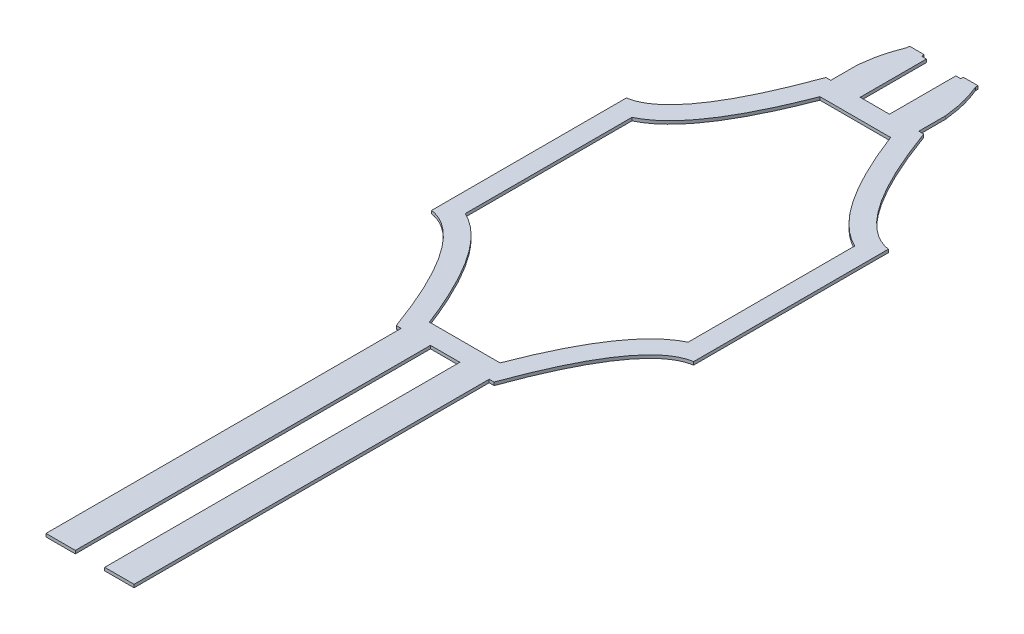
ISO-10303-21;
HEADER;
FILE_DESCRIPTION(('STEP AP214'),'2;1');
FILE_NAME('part.step','',(''),(''),'','','');
FILE_SCHEMA(('AUTOMOTIVE_DESIGN { 1 0 10303 214 1 1 1 1 }'));
ENDSEC;
DATA;
#1=APPLICATION_CONTEXT('core data for automotive mechanical design processes');
#2=APPLICATION_PROTOCOL_DEFINITION('international standard','automotive_design',2000,#1);
#3=PRODUCT_CONTEXT('',#1,'mechanical');
#4=PRODUCT('Part','Part','',(#3));
#5=PRODUCT_RELATED_PRODUCT_CATEGORY('part','',(#4));
#6=PRODUCT_DEFINITION_FORMATION('','',#4);
#7=PRODUCT_DEFINITION_CONTEXT('part definition',#1,'design');
#8=PRODUCT_DEFINITION('design','',#6,#7);
#9=PRODUCT_DEFINITION_SHAPE('','',#8);
#10=(LENGTH_UNIT() NAMED_UNIT(*) SI_UNIT(.MILLI.,.METRE.));
#11=(NAMED_UNIT(*) PLANE_ANGLE_UNIT() SI_UNIT($,.RADIAN.));
#12=(NAMED_UNIT(*) SI_UNIT($,.STERADIAN.) SOLID_ANGLE_UNIT());
#13=UNCERTAINTY_MEASURE_WITH_UNIT(LENGTH_MEASURE(1.E-05),#10,'distance_accuracy_value','');
#14=(GEOMETRIC_REPRESENTATION_CONTEXT(3) GLOBAL_UNCERTAINTY_ASSIGNED_CONTEXT((#13)) GLOBAL_UNIT_ASSIGNED_CONTEXT((#10,
#11,#12)) REPRESENTATION_CONTEXT('',''));
#15=CARTESIAN_POINT('',(0.,0.,0.));
#16=DIRECTION('',(0.,0.,1.));
#17=DIRECTION('',(1.,0.,0.));
#18=AXIS2_PLACEMENT_3D('',#15,#16,#17);
#19=CARTESIAN_POINT('',(44.9999999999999,3.175,0.));
#20=DIRECTION('',(1.,0.,0.));
#21=DIRECTION('',(0.,0.,-1.));
#22=AXIS2_PLACEMENT_3D('',#19,#20,#21);
#23=PLANE('',#22);
#24=DIRECTION('',(0.,0.,1.));
#25=VECTOR('',#24,1.);
#26=CARTESIAN_POINT('',(44.9999999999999,0.,0.));
#27=LINE('',#26,#25);
#28=CARTESIAN_POINT('',(45.,0.,-258.908417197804));
#29=VERTEX_POINT('',#28);
#30=CARTESIAN_POINT('',(45.,0.,-231.485889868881));
#31=VERTEX_POINT('',#30);
#32=EDGE_CURVE('E750',#29,#31,#27,.T.);
#33=ORIENTED_EDGE('',*,*,#32,.F.);
#34=DIRECTION('',(0.,-1.,0.));
#35=VECTOR('',#34,1.);
#36=CARTESIAN_POINT('',(45.,3.175,-258.908417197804));
#37=LINE('',#36,#35);
#38=CARTESIAN_POINT('',(45.,3.175,-258.908417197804));
#39=VERTEX_POINT('',#38);
#40=EDGE_CURVE('E11',#39,#29,#37,.T.);
#41=ORIENTED_EDGE('',*,*,#40,.F.);
#42=DIRECTION('',(0.,0.,1.));
#43=VECTOR('',#42,1.);
#44=CARTESIAN_POINT('',(44.9999999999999,3.175,0.));
#45=LINE('',#44,#43);
#46=CARTESIAN_POINT('',(45.,3.175,-231.485889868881));
#47=VERTEX_POINT('',#46);
#48=EDGE_CURVE('E502',#39,#47,#45,.T.);
#49=ORIENTED_EDGE('',*,*,#48,.T.);
#50=DIRECTION('',(0.,-1.,0.));
#51=VECTOR('',#50,1.);
#52=CARTESIAN_POINT('',(45.,3.175,-231.485889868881));
#53=LINE('',#52,#51);
#54=EDGE_CURVE('E59',#47,#31,#53,.T.);
#55=ORIENTED_EDGE('',*,*,#54,.T.);
#56=EDGE_LOOP('',(#33,#41,#49,#55));
#57=FACE_BOUND('',#56,.T.);
#58=ADVANCED_FACE('F39',(#57),#23,.T.);
#59=CARTESIAN_POINT('',(45.,3.175,-258.908417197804));
#60=CARTESIAN_POINT('',(43.4189974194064,3.175,-270.483960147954));
#61=CARTESIAN_POINT('',(42.8304672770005,3.175,-279.607046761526));
#62=CARTESIAN_POINT('',(35.,3.175,-299.285327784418));
#63=B_SPLINE_CURVE_WITH_KNOTS('',3,(#59,#60,#61,#62),.UNSPECIFIED.,.F.,.F.,(4,4),(0.,1.),.UNSPECIFIED.);
#64=DIRECTION('',(0.,-1.,0.));
#65=VECTOR('',#64,1.);
#66=SURFACE_OF_LINEAR_EXTRUSION('',#63,#65);
#67=CARTESIAN_POINT('',(45.,0.,-258.908417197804));
#68=CARTESIAN_POINT('',(43.4189974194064,0.,-270.483960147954));
#69=CARTESIAN_POINT('',(42.8304672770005,0.,-279.607046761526));
#70=CARTESIAN_POINT('',(35.,0.,-299.285327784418));
#71=B_SPLINE_CURVE_WITH_KNOTS('',3,(#67,#68,#69,#70),.UNSPECIFIED.,.F.,.F.,(4,4),(0.,1.),.UNSPECIFIED.);
#72=CARTESIAN_POINT('',(35.,0.,-299.285327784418));
#73=VERTEX_POINT('',#72);
#74=EDGE_CURVE('E753',#29,#73,#71,.T.);
#75=ORIENTED_EDGE('',*,*,#74,.T.);
#76=DIRECTION('',(0.,-1.,0.));
#77=VECTOR('',#76,1.);
#78=CARTESIAN_POINT('',(35.,3.175,-299.285327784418));
#79=LINE('',#78,#77);
#80=CARTESIAN_POINT('',(35.,3.175,-299.285327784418));
#81=VERTEX_POINT('',#80);
#82=EDGE_CURVE('E50',#81,#73,#79,.T.);
#83=ORIENTED_EDGE('',*,*,#82,.F.);
#84=EDGE_CURVE('E494',#39,#81,#63,.T.);
#85=ORIENTED_EDGE('',*,*,#84,.F.);
#86=ORIENTED_EDGE('',*,*,#40,.T.);
#87=EDGE_LOOP('',(#75,#83,#85,#86));
#88=FACE_BOUND('',#87,.T.);
#89=ADVANCED_FACE('F487',(#88),#66,.F.);
#90=CARTESIAN_POINT('',(35.,3.175,0.));
#91=DIRECTION('',(-1.,0.,0.));
#92=DIRECTION('',(0.,0.,1.));
#93=AXIS2_PLACEMENT_3D('',#90,#91,#92);
#94=PLANE('',#93);
#95=DIRECTION('',(0.,0.,-1.));
#96=VECTOR('',#95,1.);
#97=CARTESIAN_POINT('',(35.,0.,0.));
#98=LINE('',#97,#96);
#99=CARTESIAN_POINT('',(35.,0.,-301.9482486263));
#100=VERTEX_POINT('',#99);
#101=EDGE_CURVE('E757',#73,#100,#98,.T.);
#102=ORIENTED_EDGE('',*,*,#101,.T.);
#103=DIRECTION('',(0.,-1.,0.));
#104=VECTOR('',#103,1.);
#105=CARTESIAN_POINT('',(35.,3.175,-301.9482486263));
#106=LINE('',#105,#104);
#107=CARTESIAN_POINT('',(35.,3.175,-301.9482486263));
#108=VERTEX_POINT('',#107);
#109=EDGE_CURVE('E624',#108,#100,#106,.T.);
#110=ORIENTED_EDGE('',*,*,#109,.F.);
#111=DIRECTION('',(0.,0.,-1.));
#112=VECTOR('',#111,1.);
#113=CARTESIAN_POINT('',(35.,3.175,0.));
#114=LINE('',#113,#112);
#115=EDGE_CURVE('E501',#81,#108,#114,.T.);
#116=ORIENTED_EDGE('',*,*,#115,.F.);
#117=ORIENTED_EDGE('',*,*,#82,.T.);
#118=EDGE_LOOP('',(#102,#110,#116,#117));
#119=FACE_BOUND('',#118,.T.);
#120=ADVANCED_FACE('F483',(#119),#94,.F.);
#121=CARTESIAN_POINT('',(0.,3.175,-301.9482486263));
#122=DIRECTION('',(0.,0.,1.));
#123=DIRECTION('',(1.,0.,0.));
#124=AXIS2_PLACEMENT_3D('',#121,#122,#123);
#125=PLANE('',#124);
#126=DIRECTION('',(-1.,0.,0.));
#127=VECTOR('',#126,1.);
#128=CARTESIAN_POINT('',(0.,0.,-301.9482486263));
#129=LINE('',#128,#127);
#130=CARTESIAN_POINT('',(20.,0.,-301.9482486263));
#131=VERTEX_POINT('',#130);
#132=EDGE_CURVE('E771',#100,#131,#129,.T.);
#133=ORIENTED_EDGE('',*,*,#132,.T.);
#134=DIRECTION('',(0.,-1.,0.));
#135=VECTOR('',#134,1.);
#136=CARTESIAN_POINT('',(20.,3.175,-301.9482486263));
#137=LINE('',#136,#135);
#138=CARTESIAN_POINT('',(20.,3.175,-301.9482486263));
#139=VERTEX_POINT('',#138);
#140=EDGE_CURVE('E621',#139,#131,#137,.T.);
#141=ORIENTED_EDGE('',*,*,#140,.F.);
#142=DIRECTION('',(-1.,0.,0.));
#143=VECTOR('',#142,1.);
#144=CARTESIAN_POINT('',(0.,3.175,-301.9482486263));
#145=LINE('',#144,#143);
#146=EDGE_CURVE('E509',#108,#139,#145,.T.);
#147=ORIENTED_EDGE('',*,*,#146,.F.);
#148=ORIENTED_EDGE('',*,*,#109,.T.);
#149=EDGE_LOOP('',(#133,#141,#147,#148));
#150=FACE_BOUND('',#149,.T.);
#151=ADVANCED_FACE('F479',(#150),#125,.F.);
#152=CARTESIAN_POINT('',(20.,3.175,0.));
#153=DIRECTION('',(1.,0.,0.));
#154=DIRECTION('',(0.,0.,-1.));
#155=AXIS2_PLACEMENT_3D('',#152,#153,#154);
#156=PLANE('',#155);
#157=DIRECTION('',(0.,0.,1.));
#158=VECTOR('',#157,1.);
#159=CARTESIAN_POINT('',(20.,0.,0.));
#160=LINE('',#159,#158);
#161=CARTESIAN_POINT('',(20.,0.,-299.285327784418));
#162=VERTEX_POINT('',#161);
#163=EDGE_CURVE('E774',#131,#162,#160,.T.);
#164=ORIENTED_EDGE('',*,*,#163,.T.);
#165=DIRECTION('',(0.,-1.,0.));
#166=VECTOR('',#165,1.);
#167=CARTESIAN_POINT('',(20.,3.175,-299.285327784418));
#168=LINE('',#167,#166);
#169=CARTESIAN_POINT('',(20.,3.175,-299.285327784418));
#170=VERTEX_POINT('',#169);
#171=EDGE_CURVE('E618',#170,#162,#168,.T.);
#172=ORIENTED_EDGE('',*,*,#171,.F.);
#173=DIRECTION('',(0.,0.,1.));
#174=VECTOR('',#173,1.);
#175=CARTESIAN_POINT('',(20.,3.175,0.));
#176=LINE('',#175,#174);
#177=EDGE_CURVE('E512',#139,#170,#176,.T.);
#178=ORIENTED_EDGE('',*,*,#177,.F.);
#179=ORIENTED_EDGE('',*,*,#140,.T.);
#180=EDGE_LOOP('',(#164,#172,#178,#179));
#181=FACE_BOUND('',#180,.T.);
#182=ADVANCED_FACE('F475',(#181),#156,.F.);
#183=CARTESIAN_POINT('',(-1.32909384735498E-11,3.175,-299.285327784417));
#184=DIRECTION('',(0.,0.,1.));
#185=DIRECTION('',(1.,0.,0.));
#186=AXIS2_PLACEMENT_3D('',#183,#184,#185);
#187=PLANE('',#186);
#188=DIRECTION('',(-1.,0.,0.));
#189=VECTOR('',#188,1.);
#190=CARTESIAN_POINT('',(-1.32909384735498E-11,0.,-299.285327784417));
#191=LINE('',#190,#189);
#192=CARTESIAN_POINT('',(15.,0.,-299.285327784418));
#193=VERTEX_POINT('',#192);
#194=EDGE_CURVE('E777',#162,#193,#191,.T.);
#195=ORIENTED_EDGE('',*,*,#194,.T.);
#196=DIRECTION('',(0.,-1.,0.));
#197=VECTOR('',#196,1.);
#198=CARTESIAN_POINT('',(15.,3.175,-299.285327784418));
#199=LINE('',#198,#197);
#200=CARTESIAN_POINT('',(15.,3.175,-299.285327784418));
#201=VERTEX_POINT('',#200);
#202=EDGE_CURVE('E616',#201,#193,#199,.T.);
#203=ORIENTED_EDGE('',*,*,#202,.F.);
#204=DIRECTION('',(-1.,0.,0.));
#205=VECTOR('',#204,1.);
#206=CARTESIAN_POINT('',(-1.32909384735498E-11,3.175,-299.285327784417));
#207=LINE('',#206,#205);
#208=EDGE_CURVE('E515',#170,#201,#207,.T.);
#209=ORIENTED_EDGE('',*,*,#208,.F.);
#210=ORIENTED_EDGE('',*,*,#171,.T.);
#211=EDGE_LOOP('',(#195,#203,#209,#210));
#212=FACE_BOUND('',#211,.T.);
#213=ADVANCED_FACE('F471',(#212),#187,.F.);
#214=CARTESIAN_POINT('',(15.,3.175,0.));
#215=DIRECTION('',(-1.,0.,0.));
#216=DIRECTION('',(0.,0.,1.));
#217=AXIS2_PLACEMENT_3D('',#214,#215,#216);
#218=PLANE('',#217);
#219=DIRECTION('',(0.,0.,-1.));
#220=VECTOR('',#219,1.);
#221=CARTESIAN_POINT('',(15.,0.,0.));
#222=LINE('',#221,#220);
#223=CARTESIAN_POINT('',(15.,0.,-231.485889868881));
#224=VERTEX_POINT('',#223);
#225=EDGE_CURVE('E780',#224,#193,#222,.T.);
#226=ORIENTED_EDGE('',*,*,#225,.F.);
#227=DIRECTION('',(0.,-1.,0.));
#228=VECTOR('',#227,1.);
#229=CARTESIAN_POINT('',(15.,3.175,-231.485889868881));
#230=LINE('',#229,#228);
#231=CARTESIAN_POINT('',(15.,3.175,-231.485889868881));
#232=VERTEX_POINT('',#231);
#233=EDGE_CURVE('E614',#232,#224,#230,.T.);
#234=ORIENTED_EDGE('',*,*,#233,.F.);
#235=DIRECTION('',(0.,0.,-1.));
#236=VECTOR('',#235,1.);
#237=CARTESIAN_POINT('',(15.,3.175,0.));
#238=LINE('',#237,#236);
#239=EDGE_CURVE('E517',#232,#201,#238,.T.);
#240=ORIENTED_EDGE('',*,*,#239,.T.);
#241=ORIENTED_EDGE('',*,*,#202,.T.);
#242=EDGE_LOOP('',(#226,#234,#240,#241));
#243=FACE_BOUND('',#242,.T.);
#244=ADVANCED_FACE('F467',(#243),#218,.T.);
#245=CARTESIAN_POINT('',(-1.7133397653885E-12,3.175,-231.485889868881));
#246=DIRECTION('',(0.,0.,1.));
#247=DIRECTION('',(1.,0.,0.));
#248=AXIS2_PLACEMENT_3D('',#245,#246,#247);
#249=PLANE('',#248);
#250=DIRECTION('',(-1.,0.,0.));
#251=VECTOR('',#250,1.);
#252=CARTESIAN_POINT('',(-1.7133397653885E-12,0.,-231.485889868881));
#253=LINE('',#252,#251);
#254=CARTESIAN_POINT('',(-15.,0.,-231.485889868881));
#255=VERTEX_POINT('',#254);
#256=EDGE_CURVE('E783',#224,#255,#253,.T.);
#257=ORIENTED_EDGE('',*,*,#256,.T.);
#258=DIRECTION('',(0.,-1.,0.));
#259=VECTOR('',#258,1.);
#260=CARTESIAN_POINT('',(-15.,3.175,-231.485889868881));
#261=LINE('',#260,#259);
#262=CARTESIAN_POINT('',(-15.,3.175,-231.485889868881));
#263=VERTEX_POINT('',#262);
#264=EDGE_CURVE('E612',#263,#255,#261,.T.);
#265=ORIENTED_EDGE('',*,*,#264,.F.);
#266=DIRECTION('',(-1.,0.,0.));
#267=VECTOR('',#266,1.);
#268=CARTESIAN_POINT('',(-1.7133397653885E-12,3.175,-231.485889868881));
#269=LINE('',#268,#267);
#270=EDGE_CURVE('E520',#232,#263,#269,.T.);
#271=ORIENTED_EDGE('',*,*,#270,.F.);
#272=ORIENTED_EDGE('',*,*,#233,.T.);
#273=EDGE_LOOP('',(#257,#265,#271,#272));
#274=FACE_BOUND('',#273,.T.);
#275=ADVANCED_FACE('F463',(#274),#249,.F.);
#276=CARTESIAN_POINT('',(-15.,3.175,0.));
#277=DIRECTION('',(1.,0.,0.));
#278=DIRECTION('',(0.,0.,-1.));
#279=AXIS2_PLACEMENT_3D('',#276,#277,#278);
#280=PLANE('',#279);
#281=DIRECTION('',(0.,0.,1.));
#282=VECTOR('',#281,1.);
#283=CARTESIAN_POINT('',(-15.,0.,0.));
#284=LINE('',#283,#282);
#285=CARTESIAN_POINT('',(-15.,0.,-299.285327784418));
#286=VERTEX_POINT('',#285);
#287=EDGE_CURVE('E786',#286,#255,#284,.T.);
#288=ORIENTED_EDGE('',*,*,#287,.F.);
#289=DIRECTION('',(0.,-1.,0.));
#290=VECTOR('',#289,1.);
#291=CARTESIAN_POINT('',(-15.,3.175,-299.285327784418));
#292=LINE('',#291,#290);
#293=CARTESIAN_POINT('',(-15.,3.175,-299.285327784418));
#294=VERTEX_POINT('',#293);
#295=EDGE_CURVE('E610',#294,#286,#292,.T.);
#296=ORIENTED_EDGE('',*,*,#295,.F.);
#297=DIRECTION('',(0.,0.,1.));
#298=VECTOR('',#297,1.);
#299=CARTESIAN_POINT('',(-15.,3.175,0.));
#300=LINE('',#299,#298);
#301=EDGE_CURVE('E522',#294,#263,#300,.T.);
#302=ORIENTED_EDGE('',*,*,#301,.T.);
#303=ORIENTED_EDGE('',*,*,#264,.T.);
#304=EDGE_LOOP('',(#288,#296,#302,#303));
#305=FACE_BOUND('',#304,.T.);
#306=ADVANCED_FACE('F459',(#305),#280,.T.);
#307=CARTESIAN_POINT('',(1.32909384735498E-11,3.175,-299.285327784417));
#308=DIRECTION('',(0.,0.,-1.));
#309=DIRECTION('',(-1.,0.,0.));
#310=AXIS2_PLACEMENT_3D('',#307,#308,#309);
#311=PLANE('',#310);
#312=DIRECTION('',(1.,0.,0.));
#313=VECTOR('',#312,1.);
#314=CARTESIAN_POINT('',(1.32909384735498E-11,0.,-299.285327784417));
#315=LINE('',#314,#313);
#316=CARTESIAN_POINT('',(-20.,0.,-299.285327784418));
#317=VERTEX_POINT('',#316);
#318=EDGE_CURVE('E789',#317,#286,#315,.T.);
#319=ORIENTED_EDGE('',*,*,#318,.F.);
#320=DIRECTION('',(0.,-1.,0.));
#321=VECTOR('',#320,1.);
#322=CARTESIAN_POINT('',(-20.,3.175,-299.285327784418));
#323=LINE('',#322,#321);
#324=CARTESIAN_POINT('',(-20.,3.175,-299.285327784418));
#325=VERTEX_POINT('',#324);
#326=EDGE_CURVE('E608',#325,#317,#323,.T.);
#327=ORIENTED_EDGE('',*,*,#326,.F.);
#328=DIRECTION('',(1.,0.,0.));
#329=VECTOR('',#328,1.);
#330=CARTESIAN_POINT('',(1.32909384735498E-11,3.175,-299.285327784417));
#331=LINE('',#330,#329);
#332=EDGE_CURVE('E525',#325,#294,#331,.T.);
#333=ORIENTED_EDGE('',*,*,#332,.T.);
#334=ORIENTED_EDGE('',*,*,#295,.T.);
#335=EDGE_LOOP('',(#319,#327,#333,#334));
#336=FACE_BOUND('',#335,.T.);
#337=ADVANCED_FACE('F455',(#336),#311,.T.);
#338=CARTESIAN_POINT('',(-20.,3.175,0.));
#339=DIRECTION('',(1.,0.,0.));
#340=DIRECTION('',(0.,0.,-1.));
#341=AXIS2_PLACEMENT_3D('',#338,#339,#340);
#342=PLANE('',#341);
#343=DIRECTION('',(0.,0.,1.));
#344=VECTOR('',#343,1.);
#345=CARTESIAN_POINT('',(-20.,0.,0.));
#346=LINE('',#345,#344);
#347=CARTESIAN_POINT('',(-20.,0.,-301.9482486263));
#348=VERTEX_POINT('',#347);
#349=EDGE_CURVE('E792',#348,#317,#346,.T.);
#350=ORIENTED_EDGE('',*,*,#349,.F.);
#351=DIRECTION('',(0.,-1.,0.));
#352=VECTOR('',#351,1.);
#353=CARTESIAN_POINT('',(-20.,3.175,-301.9482486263));
#354=LINE('',#353,#352);
#355=CARTESIAN_POINT('',(-20.,3.175,-301.9482486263));
#356=VERTEX_POINT('',#355);
#357=EDGE_CURVE('E606',#356,#348,#354,.T.);
#358=ORIENTED_EDGE('',*,*,#357,.F.);
#359=DIRECTION('',(0.,0.,1.));
#360=VECTOR('',#359,1.);
#361=CARTESIAN_POINT('',(-20.,3.175,0.));
#362=LINE('',#361,#360);
#363=EDGE_CURVE('E528',#356,#325,#362,.T.);
#364=ORIENTED_EDGE('',*,*,#363,.T.);
#365=ORIENTED_EDGE('',*,*,#326,.T.);
#366=EDGE_LOOP('',(#350,#358,#364,#365));
#367=FACE_BOUND('',#366,.T.);
#368=ADVANCED_FACE('F451',(#367),#342,.T.);
#369=CARTESIAN_POINT('',(0.,3.175,-301.9482486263));
#370=DIRECTION('',(0.,0.,-1.));
#371=DIRECTION('',(-1.,0.,0.));
#372=AXIS2_PLACEMENT_3D('',#369,#370,#371);
#373=PLANE('',#372);
#374=DIRECTION('',(1.,0.,0.));
#375=VECTOR('',#374,1.);
#376=CARTESIAN_POINT('',(0.,0.,-301.9482486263));
#377=LINE('',#376,#375);
#378=CARTESIAN_POINT('',(-35.,0.,-301.9482486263));
#379=VERTEX_POINT('',#378);
#380=EDGE_CURVE('E795',#379,#348,#377,.T.);
#381=ORIENTED_EDGE('',*,*,#380,.F.);
#382=DIRECTION('',(0.,-1.,0.));
#383=VECTOR('',#382,1.);
#384=CARTESIAN_POINT('',(-35.,3.175,-301.9482486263));
#385=LINE('',#384,#383);
#386=CARTESIAN_POINT('',(-35.,3.175,-301.9482486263));
#387=VERTEX_POINT('',#386);
#388=EDGE_CURVE('E536',#387,#379,#385,.T.);
#389=ORIENTED_EDGE('',*,*,#388,.F.);
#390=DIRECTION('',(1.,0.,0.));
#391=VECTOR('',#390,1.);
#392=CARTESIAN_POINT('',(0.,3.175,-301.9482486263));
#393=LINE('',#392,#391);
#394=EDGE_CURVE('E530',#387,#356,#393,.T.);
#395=ORIENTED_EDGE('',*,*,#394,.T.);
#396=ORIENTED_EDGE('',*,*,#357,.T.);
#397=EDGE_LOOP('',(#381,#389,#395,#396));
#398=FACE_BOUND('',#397,.T.);
#399=ADVANCED_FACE('F447',(#398),#373,.T.);
#400=CARTESIAN_POINT('',(-35.,3.175,0.));
#401=DIRECTION('',(-1.,0.,0.));
#402=DIRECTION('',(0.,0.,1.));
#403=AXIS2_PLACEMENT_3D('',#400,#401,#402);
#404=PLANE('',#403);
#405=DIRECTION('',(0.,0.,-1.));
#406=VECTOR('',#405,1.);
#407=CARTESIAN_POINT('',(-35.,0.,0.));
#408=LINE('',#407,#406);
#409=CARTESIAN_POINT('',(-35.,0.,-299.285327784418));
#410=VERTEX_POINT('',#409);
#411=EDGE_CURVE('E798',#410,#379,#408,.T.);
#412=ORIENTED_EDGE('',*,*,#411,.F.);
#413=DIRECTION('',(0.,-1.,0.));
#414=VECTOR('',#413,1.);
#415=CARTESIAN_POINT('',(-35.,3.175,-299.285327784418));
#416=LINE('',#415,#414);
#417=CARTESIAN_POINT('',(-35.,3.175,-299.285327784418));
#418=VERTEX_POINT('',#417);
#419=EDGE_CURVE('E538',#418,#410,#416,.T.);
#420=ORIENTED_EDGE('',*,*,#419,.F.);
#421=DIRECTION('',(0.,0.,-1.));
#422=VECTOR('',#421,1.);
#423=CARTESIAN_POINT('',(-35.,3.175,0.));
#424=LINE('',#423,#422);
#425=EDGE_CURVE('E433',#418,#387,#424,.T.);
#426=ORIENTED_EDGE('',*,*,#425,.T.);
#427=ORIENTED_EDGE('',*,*,#388,.T.);
#428=EDGE_LOOP('',(#412,#420,#426,#427));
#429=FACE_BOUND('',#428,.T.);
#430=ADVANCED_FACE('F443',(#429),#404,.T.);
#431=CARTESIAN_POINT('',(-45.,3.175,-258.908417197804));
#432=CARTESIAN_POINT('',(-43.4189974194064,3.175,-270.483960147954));
#433=CARTESIAN_POINT('',(-42.8304672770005,3.175,-279.607046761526));
#434=CARTESIAN_POINT('',(-35.,3.175,-299.285327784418));
#435=B_SPLINE_CURVE_WITH_KNOTS('',3,(#431,#432,#433,#434),.UNSPECIFIED.,.F.,.F.,(4,4),(0.,1.),.UNSPECIFIED.);
#436=DIRECTION('',(0.,-1.,0.));
#437=VECTOR('',#436,1.);
#438=SURFACE_OF_LINEAR_EXTRUSION('',#435,#437);
#439=CARTESIAN_POINT('',(-45.,0.,-258.908417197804));
#440=CARTESIAN_POINT('',(-43.4189974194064,0.,-270.483960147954));
#441=CARTESIAN_POINT('',(-42.8304672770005,0.,-279.607046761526));
#442=CARTESIAN_POINT('',(-35.,0.,-299.285327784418));
#443=B_SPLINE_CURVE_WITH_KNOTS('',3,(#439,#440,#441,#442),.UNSPECIFIED.,.F.,.F.,(4,4),(0.,1.),.UNSPECIFIED.);
#444=CARTESIAN_POINT('',(-45.,0.,-258.908417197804));
#445=VERTEX_POINT('',#444);
#446=EDGE_CURVE('E545',#445,#410,#443,.T.);
#447=ORIENTED_EDGE('',*,*,#446,.F.);
#448=DIRECTION('',(0.,-1.,0.));
#449=VECTOR('',#448,1.);
#450=CARTESIAN_POINT('',(-45.,3.175,-258.908417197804));
#451=LINE('',#450,#449);
#452=CARTESIAN_POINT('',(-45.,3.175,-258.908417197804));
#453=VERTEX_POINT('',#452);
#454=EDGE_CURVE('E542',#453,#445,#451,.T.);
#455=ORIENTED_EDGE('',*,*,#454,.F.);
#456=EDGE_CURVE('E427',#453,#418,#435,.T.);
#457=ORIENTED_EDGE('',*,*,#456,.T.);
#458=ORIENTED_EDGE('',*,*,#419,.T.);
#459=EDGE_LOOP('',(#447,#455,#457,#458));
#460=FACE_BOUND('',#459,.T.);
#461=ADVANCED_FACE('F439',(#460),#438,.T.);
#462=CARTESIAN_POINT('',(-44.9999999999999,3.175,0.));
#463=DIRECTION('',(1.,0.,0.));
#464=DIRECTION('',(0.,0.,-1.));
#465=AXIS2_PLACEMENT_3D('',#462,#463,#464);
#466=PLANE('',#465);
#467=DIRECTION('',(0.,0.,1.));
#468=VECTOR('',#467,1.);
#469=CARTESIAN_POINT('',(-44.9999999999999,0.,0.));
#470=LINE('',#469,#468);
#471=CARTESIAN_POINT('',(-45.,0.,-231.485889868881));
#472=VERTEX_POINT('',#471);
#473=EDGE_CURVE('E804',#445,#472,#470,.T.);
#474=ORIENTED_EDGE('',*,*,#473,.T.);
#475=DIRECTION('',(0.,-1.,0.));
#476=VECTOR('',#475,1.);
#477=CARTESIAN_POINT('',(-45.,3.175,-231.485889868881));
#478=LINE('',#477,#476);
#479=CARTESIAN_POINT('',(-45.,3.175,-231.485889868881));
#480=VERTEX_POINT('',#479);
#481=EDGE_CURVE('E549',#480,#472,#478,.T.);
#482=ORIENTED_EDGE('',*,*,#481,.F.);
#483=DIRECTION('',(0.,0.,1.));
#484=VECTOR('',#483,1.);
#485=CARTESIAN_POINT('',(-44.9999999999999,3.175,0.));
#486=LINE('',#485,#484);
#487=EDGE_CURVE('E425',#453,#480,#486,.T.);
#488=ORIENTED_EDGE('',*,*,#487,.F.);
#489=ORIENTED_EDGE('',*,*,#454,.T.);
#490=EDGE_LOOP('',(#474,#482,#488,#489));
#491=FACE_BOUND('',#490,.T.);
#492=ADVANCED_FACE('F442',(#491),#466,.F.);
#493=CARTESIAN_POINT('',(1.02800385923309E-11,3.175,-231.485889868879));
#494=DIRECTION('',(0.,0.,-1.));
#495=DIRECTION('',(-1.,0.,0.));
#496=AXIS2_PLACEMENT_3D('',#493,#494,#495);
#497=PLANE('',#496);
#498=DIRECTION('',(1.,0.,0.));
#499=VECTOR('',#498,1.);
#500=CARTESIAN_POINT('',(1.02800385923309E-11,0.,-231.485889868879));
#501=LINE('',#500,#499);
#502=CARTESIAN_POINT('',(-50.,0.,-231.485889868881));
#503=VERTEX_POINT('',#502);
#504=EDGE_CURVE('E560',#503,#472,#501,.T.);
#505=ORIENTED_EDGE('',*,*,#504,.F.);
#506=DIRECTION('',(0.,-1.,0.));
#507=VECTOR('',#506,1.);
#508=CARTESIAN_POINT('',(-50.,3.175,-231.485889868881));
#509=LINE('',#508,#507);
#510=CARTESIAN_POINT('',(-50.,3.175,-231.485889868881));
#511=VERTEX_POINT('',#510);
#512=EDGE_CURVE('E558',#511,#503,#509,.T.);
#513=ORIENTED_EDGE('',*,*,#512,.F.);
#514=DIRECTION('',(1.,0.,0.));
#515=VECTOR('',#514,1.);
#516=CARTESIAN_POINT('',(1.02800385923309E-11,3.175,-231.485889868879));
#517=LINE('',#516,#515);
#518=EDGE_CURVE('E419',#511,#480,#517,.T.);
#519=ORIENTED_EDGE('',*,*,#518,.T.);
#520=ORIENTED_EDGE('',*,*,#481,.T.);
#521=EDGE_LOOP('',(#505,#513,#519,#520));
#522=FACE_BOUND('',#521,.T.);
#523=ADVANCED_FACE('F411',(#522),#497,.T.);
#524=CARTESIAN_POINT('',(-50.,3.175,-231.485889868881));
#525=CARTESIAN_POINT('',(-84.0837481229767,3.175,-137.245174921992));
#526=CARTESIAN_POINT('',(-113.787224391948,3.175,-114.335183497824));
#527=CARTESIAN_POINT('',(-133.879,3.175,-111.485889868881));
#528=B_SPLINE_CURVE_WITH_KNOTS('',3,(#524,#525,#526,#527),.UNSPECIFIED.,.F.,.F.,(4,4),
(0.0479582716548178,0.909985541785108),.UNSPECIFIED.);
#529=DIRECTION('',(0.,-1.,0.));
#530=VECTOR('',#529,1.);
#531=SURFACE_OF_LINEAR_EXTRUSION('',#528,#530);
#532=CARTESIAN_POINT('',(-50.,0.,-231.485889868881));
#533=CARTESIAN_POINT('',(-84.0837481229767,0.,-137.245174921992));
#534=CARTESIAN_POINT('',(-113.787224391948,0.,-114.335183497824));
#535=CARTESIAN_POINT('',(-133.879,0.,-111.485889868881));
#536=B_SPLINE_CURVE_WITH_KNOTS('',3,(#532,#533,#534,#535),.UNSPECIFIED.,.F.,.F.,(4,4),
(0.0479582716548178,0.909985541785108),.UNSPECIFIED.);
#537=CARTESIAN_POINT('',(-133.879,0.,-111.485889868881));
#538=VERTEX_POINT('',#537);
#539=EDGE_CURVE('E566',#503,#538,#536,.T.);
#540=ORIENTED_EDGE('',*,*,#539,.T.);
#541=DIRECTION('',(0.,-1.,0.));
#542=VECTOR('',#541,1.);
#543=CARTESIAN_POINT('',(-133.879,3.175,-111.485889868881));
#544=LINE('',#543,#542);
#545=CARTESIAN_POINT('',(-133.879,3.175,-111.485889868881));
#546=VERTEX_POINT('',#545);
#547=EDGE_CURVE('E563',#546,#538,#544,.T.);
#548=ORIENTED_EDGE('',*,*,#547,.F.);
#549=EDGE_CURVE('E414',#511,#546,#528,.T.);
#550=ORIENTED_EDGE('',*,*,#549,.F.);
#551=ORIENTED_EDGE('',*,*,#512,.T.);
#552=EDGE_LOOP('',(#540,#548,#550,#551));
#553=FACE_BOUND('',#552,.T.);
#554=ADVANCED_FACE('F407',(#553),#531,.F.);
#555=CARTESIAN_POINT('',(-133.879,3.175,0.));
#556=DIRECTION('',(-1.,0.,0.));
#557=DIRECTION('',(0.,0.,1.));
#558=AXIS2_PLACEMENT_3D('',#555,#556,#557);
#559=PLANE('',#558);
#560=DIRECTION('',(0.,0.,-1.));
#561=VECTOR('',#560,1.);
#562=CARTESIAN_POINT('',(-133.879,0.,0.));
#563=LINE('',#562,#561);
#564=CARTESIAN_POINT('',(-133.879,0.,87.6641101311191));
#565=VERTEX_POINT('',#564);
#566=EDGE_CURVE('E813',#565,#538,#563,.T.);
#567=ORIENTED_EDGE('',*,*,#566,.F.);
#568=DIRECTION('',(0.,-1.,0.));
#569=VECTOR('',#568,1.);
#570=CARTESIAN_POINT('',(-133.879,3.175,87.6641101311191));
#571=LINE('',#570,#569);
#572=CARTESIAN_POINT('',(-133.879,3.175,87.6641101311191));
#573=VERTEX_POINT('',#572);
#574=EDGE_CURVE('E569',#573,#565,#571,.T.);
#575=ORIENTED_EDGE('',*,*,#574,.F.);
#576=DIRECTION('',(0.,0.,-1.));
#577=VECTOR('',#576,1.);
#578=CARTESIAN_POINT('',(-133.879,3.175,0.));
#579=LINE('',#578,#577);
#580=EDGE_CURVE('E391',#573,#546,#579,.T.);
#581=ORIENTED_EDGE('',*,*,#580,.T.);
#582=ORIENTED_EDGE('',*,*,#547,.T.);
#583=EDGE_LOOP('',(#567,#575,#581,#582));
#584=FACE_BOUND('',#583,.T.);
#585=ADVANCED_FACE('F402',(#584),#559,.T.);
#586=CARTESIAN_POINT('',(-50.,3.175,207.664110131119));
#587=CARTESIAN_POINT('',(-84.0837481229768,3.175,113.42339518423));
#588=CARTESIAN_POINT('',(-113.787224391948,3.175,90.5134037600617));
#589=CARTESIAN_POINT('',(-133.879,3.175,87.6641101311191));
#590=B_SPLINE_CURVE_WITH_KNOTS('',3,(#586,#587,#588,#589),.UNSPECIFIED.,.F.,.F.,(4,4),
(0.0479582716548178,0.909985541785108),.UNSPECIFIED.);
#591=DIRECTION('',(0.,-1.,0.));
#592=VECTOR('',#591,1.);
#593=SURFACE_OF_LINEAR_EXTRUSION('',#590,#592);
#594=CARTESIAN_POINT('',(-50.,0.,207.664110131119));
#595=CARTESIAN_POINT('',(-84.0837481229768,0.,113.42339518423));
#596=CARTESIAN_POINT('',(-113.787224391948,0.,90.5134037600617));
#597=CARTESIAN_POINT('',(-133.879,0.,87.6641101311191));
#598=B_SPLINE_CURVE_WITH_KNOTS('',3,(#594,#595,#596,#597),.UNSPECIFIED.,.F.,.F.,(4,4),
(0.0479582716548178,0.909985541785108),.UNSPECIFIED.);
#599=CARTESIAN_POINT('',(-50.,0.,207.664110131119));
#600=VERTEX_POINT('',#599);
#601=EDGE_CURVE('E576',#600,#565,#598,.T.);
#602=ORIENTED_EDGE('',*,*,#601,.F.);
#603=DIRECTION('',(0.,-1.,0.));
#604=VECTOR('',#603,1.);
#605=CARTESIAN_POINT('',(-50.,3.175,207.664110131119));
#606=LINE('',#605,#604);
#607=CARTESIAN_POINT('',(-50.,3.175,207.664110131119));
#608=VERTEX_POINT('',#607);
#609=EDGE_CURVE('E573',#608,#600,#606,.T.);
#610=ORIENTED_EDGE('',*,*,#609,.F.);
#611=EDGE_CURVE('E385',#608,#573,#590,.T.);
#612=ORIENTED_EDGE('',*,*,#611,.T.);
#613=ORIENTED_EDGE('',*,*,#574,.T.);
#614=EDGE_LOOP('',(#602,#610,#612,#613));
#615=FACE_BOUND('',#614,.T.);
#616=ADVANCED_FACE('F397',(#615),#593,.T.);
#617=CARTESIAN_POINT('',(1.03749064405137E-11,3.175,207.664110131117));
#618=DIRECTION('',(0.,0.,-1.));
#619=DIRECTION('',(-1.,0.,0.));
#620=AXIS2_PLACEMENT_3D('',#617,#618,#619);
#621=PLANE('',#620);
#622=DIRECTION('',(1.,0.,0.));
#623=VECTOR('',#622,1.);
#624=CARTESIAN_POINT('',(1.03749064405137E-11,0.,207.664110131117));
#625=LINE('',#624,#623);
#626=CARTESIAN_POINT('',(-45.,0.,207.664110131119));
#627=VERTEX_POINT('',#626);
#628=EDGE_CURVE('E821',#600,#627,#625,.T.);
#629=ORIENTED_EDGE('',*,*,#628,.T.);
#630=DIRECTION('',(0.,-1.,0.));
#631=VECTOR('',#630,1.);
#632=CARTESIAN_POINT('',(-45.,3.175,207.664110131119));
#633=LINE('',#632,#631);
#634=CARTESIAN_POINT('',(-45.,3.175,207.664110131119));
#635=VERTEX_POINT('',#634);
#636=EDGE_CURVE('E580',#635,#627,#633,.T.);
#637=ORIENTED_EDGE('',*,*,#636,.F.);
#638=DIRECTION('',(1.,0.,0.));
#639=VECTOR('',#638,1.);
#640=CARTESIAN_POINT('',(1.03749064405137E-11,3.175,207.664110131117));
#641=LINE('',#640,#639);
#642=EDGE_CURVE('E382',#608,#635,#641,.T.);
#643=ORIENTED_EDGE('',*,*,#642,.F.);
#644=ORIENTED_EDGE('',*,*,#609,.T.);
#645=EDGE_LOOP('',(#629,#637,#643,#644));
#646=FACE_BOUND('',#645,.T.);
#647=ADVANCED_FACE('F401',(#646),#621,.F.);
#648=CARTESIAN_POINT('',(-45.0000000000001,3.175,0.));
#649=DIRECTION('',(1.,0.,0.));
#650=DIRECTION('',(0.,0.,-1.));
#651=AXIS2_PLACEMENT_3D('',#648,#649,#650);
#652=PLANE('',#651);
#653=DIRECTION('',(0.,0.,1.));
#654=VECTOR('',#653,1.);
#655=CARTESIAN_POINT('',(-45.0000000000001,0.,0.));
#656=LINE('',#655,#654);
#657=CARTESIAN_POINT('',(-44.9999999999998,0.,570.664110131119));
#658=VERTEX_POINT('',#657);
#659=EDGE_CURVE('E591',#627,#658,#656,.T.);
#660=ORIENTED_EDGE('',*,*,#659,.T.);
#661=DIRECTION('',(0.,-1.,0.));
#662=VECTOR('',#661,1.);
#663=CARTESIAN_POINT('',(-44.9999999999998,3.175,570.664110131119));
#664=LINE('',#663,#662);
#665=CARTESIAN_POINT('',(-44.9999999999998,3.175,570.664110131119));
#666=VERTEX_POINT('',#665);
#667=EDGE_CURVE('E589',#666,#658,#664,.T.);
#668=ORIENTED_EDGE('',*,*,#667,.F.);
#669=DIRECTION('',(0.,0.,1.));
#670=VECTOR('',#669,1.);
#671=CARTESIAN_POINT('',(-45.0000000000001,3.175,0.));
#672=LINE('',#671,#670);
#673=EDGE_CURVE('E379',#635,#666,#672,.T.);
#674=ORIENTED_EDGE('',*,*,#673,.F.);
#675=ORIENTED_EDGE('',*,*,#636,.T.);
#676=EDGE_LOOP('',(#660,#668,#674,#675));
#677=FACE_BOUND('',#676,.T.);
#678=ADVANCED_FACE('F590',(#677),#652,.F.);
#679=CARTESIAN_POINT('',(0.,3.175,570.664110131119));
#680=DIRECTION('',(0.,0.,-1.));
#681=DIRECTION('',(-1.,0.,0.));
#682=AXIS2_PLACEMENT_3D('',#679,#680,#681);
#683=PLANE('',#682);
#684=DIRECTION('',(1.,0.,0.));
#685=VECTOR('',#684,1.);
#686=CARTESIAN_POINT('',(0.,0.,570.664110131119));
#687=LINE('',#686,#685);
#688=CARTESIAN_POINT('',(-15.,0.,570.664110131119));
#689=VERTEX_POINT('',#688);
#690=EDGE_CURVE('E682',#658,#689,#687,.T.);
#691=ORIENTED_EDGE('',*,*,#690,.T.);
#692=DIRECTION('',(0.,-1.,0.));
#693=VECTOR('',#692,1.);
#694=CARTESIAN_POINT('',(-15.,3.175,570.664110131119));
#695=LINE('',#694,#693);
#696=CARTESIAN_POINT('',(-15.,3.175,570.664110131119));
#697=VERTEX_POINT('',#696);
#698=EDGE_CURVE('E594',#697,#689,#695,.T.);
#699=ORIENTED_EDGE('',*,*,#698,.F.);
#700=DIRECTION('',(1.,0.,0.));
#701=VECTOR('',#700,1.);
#702=CARTESIAN_POINT('',(0.,3.175,570.664110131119));
#703=LINE('',#702,#701);
#704=EDGE_CURVE('E376',#666,#697,#703,.T.);
#705=ORIENTED_EDGE('',*,*,#704,.F.);
#706=ORIENTED_EDGE('',*,*,#667,.T.);
#707=EDGE_LOOP('',(#691,#699,#705,#706));
#708=FACE_BOUND('',#707,.T.);
#709=ADVANCED_FACE('F826',(#708),#683,.F.);
#710=CARTESIAN_POINT('',(-15.,3.175,0.));
#711=DIRECTION('',(-1.,0.,0.));
#712=DIRECTION('',(0.,0.,1.));
#713=AXIS2_PLACEMENT_3D('',#710,#711,#712);
#714=PLANE('',#713);
#715=DIRECTION('',(0.,0.,-1.));
#716=VECTOR('',#715,1.);
#717=CARTESIAN_POINT('',(-15.,0.,0.));
#718=LINE('',#717,#716);
#719=CARTESIAN_POINT('',(-15.,0.,207.664110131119));
#720=VERTEX_POINT('',#719);
#721=EDGE_CURVE('E679',#689,#720,#718,.T.);
#722=ORIENTED_EDGE('',*,*,#721,.T.);
#723=DIRECTION('',(0.,-1.,0.));
#724=VECTOR('',#723,1.);
#725=CARTESIAN_POINT('',(-15.,3.175,207.664110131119));
#726=LINE('',#725,#724);
#727=CARTESIAN_POINT('',(-15.,3.175,207.664110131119));
#728=VERTEX_POINT('',#727);
#729=EDGE_CURVE('E598',#728,#720,#726,.T.);
#730=ORIENTED_EDGE('',*,*,#729,.F.);
#731=DIRECTION('',(0.,0.,-1.));
#732=VECTOR('',#731,1.);
#733=CARTESIAN_POINT('',(-15.,3.175,0.));
#734=LINE('',#733,#732);
#735=EDGE_CURVE('E373',#697,#728,#734,.T.);
#736=ORIENTED_EDGE('',*,*,#735,.F.);
#737=ORIENTED_EDGE('',*,*,#698,.T.);
#738=EDGE_LOOP('',(#722,#730,#736,#737));
#739=FACE_BOUND('',#738,.T.);
#740=ADVANCED_FACE('F680',(#739),#714,.F.);
#741=CARTESIAN_POINT('',(-1.53702317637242E-12,3.175,207.664110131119));
#742=DIRECTION('',(0.,0.,-1.));
#743=DIRECTION('',(-1.,0.,0.));
#744=AXIS2_PLACEMENT_3D('',#741,#742,#743);
#745=PLANE('',#744);
#746=DIRECTION('',(1.,0.,0.));
#747=VECTOR('',#746,1.);
#748=CARTESIAN_POINT('',(-1.53702317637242E-12,0.,207.664110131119));
#749=LINE('',#748,#747);
#750=CARTESIAN_POINT('',(15.,0.,207.664110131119));
#751=VERTEX_POINT('',#750);
#752=EDGE_CURVE('E677',#720,#751,#749,.T.);
#753=ORIENTED_EDGE('',*,*,#752,.T.);
#754=DIRECTION('',(0.,-1.,0.));
#755=VECTOR('',#754,1.);
#756=CARTESIAN_POINT('',(15.,3.175,207.664110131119));
#757=LINE('',#756,#755);
#758=CARTESIAN_POINT('',(15.,3.175,207.664110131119));
#759=VERTEX_POINT('',#758);
#760=EDGE_CURVE('E668',#759,#751,#757,.T.);
#761=ORIENTED_EDGE('',*,*,#760,.F.);
#762=DIRECTION('',(1.,0.,0.));
#763=VECTOR('',#762,1.);
#764=CARTESIAN_POINT('',(-1.53702317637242E-12,3.175,207.664110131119));
#765=LINE('',#764,#763);
#766=EDGE_CURVE('E370',#728,#759,#765,.T.);
#767=ORIENTED_EDGE('',*,*,#766,.F.);
#768=ORIENTED_EDGE('',*,*,#729,.T.);
#769=EDGE_LOOP('',(#753,#761,#767,#768));
#770=FACE_BOUND('',#769,.T.);
#771=ADVANCED_FACE('F675',(#770),#745,.F.);
#772=CARTESIAN_POINT('',(15.,3.175,0.));
#773=DIRECTION('',(1.,0.,0.));
#774=DIRECTION('',(0.,0.,-1.));
#775=AXIS2_PLACEMENT_3D('',#772,#773,#774);
#776=PLANE('',#775);
#777=DIRECTION('',(0.,0.,1.));
#778=VECTOR('',#777,1.);
#779=CARTESIAN_POINT('',(15.,0.,0.));
#780=LINE('',#779,#778);
#781=CARTESIAN_POINT('',(15.,0.,570.664110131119));
#782=VERTEX_POINT('',#781);
#783=EDGE_CURVE('E684',#751,#782,#780,.T.);
#784=ORIENTED_EDGE('',*,*,#783,.T.);
#785=DIRECTION('',(0.,-1.,0.));
#786=VECTOR('',#785,1.);
#787=CARTESIAN_POINT('',(15.,3.175,570.664110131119));
#788=LINE('',#787,#786);
#789=CARTESIAN_POINT('',(15.,3.175,570.664110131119));
#790=VERTEX_POINT('',#789);
#791=EDGE_CURVE('E665',#790,#782,#788,.T.);
#792=ORIENTED_EDGE('',*,*,#791,.F.);
#793=DIRECTION('',(0.,0.,1.));
#794=VECTOR('',#793,1.);
#795=CARTESIAN_POINT('',(15.,3.175,0.));
#796=LINE('',#795,#794);
#797=EDGE_CURVE('E367',#759,#790,#796,.T.);
#798=ORIENTED_EDGE('',*,*,#797,.F.);
#799=ORIENTED_EDGE('',*,*,#760,.T.);
#800=EDGE_LOOP('',(#784,#792,#798,#799));
#801=FACE_BOUND('',#800,.T.);
#802=ADVANCED_FACE('F837',(#801),#776,.F.);
#803=CARTESIAN_POINT('',(0.,3.175,570.664110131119));
#804=DIRECTION('',(0.,0.,-1.));
#805=DIRECTION('',(-1.,0.,0.));
#806=AXIS2_PLACEMENT_3D('',#803,#804,#805);
#807=PLANE('',#806);
#808=DIRECTION('',(1.,0.,0.));
#809=VECTOR('',#808,1.);
#810=CARTESIAN_POINT('',(0.,0.,570.664110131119));
#811=LINE('',#810,#809);
#812=CARTESIAN_POINT('',(45.,0.,570.664110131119));
#813=VERTEX_POINT('',#812);
#814=EDGE_CURVE('E691',#782,#813,#811,.T.);
#815=ORIENTED_EDGE('',*,*,#814,.T.);
#816=DIRECTION('',(0.,-1.,0.));
#817=VECTOR('',#816,1.);
#818=CARTESIAN_POINT('',(45.,3.175,570.664110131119));
#819=LINE('',#818,#817);
#820=CARTESIAN_POINT('',(45.,3.175,570.664110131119));
#821=VERTEX_POINT('',#820);
#822=EDGE_CURVE('E662',#821,#813,#819,.T.);
#823=ORIENTED_EDGE('',*,*,#822,.F.);
#824=DIRECTION('',(1.,0.,0.));
#825=VECTOR('',#824,1.);
#826=CARTESIAN_POINT('',(0.,3.175,570.664110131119));
#827=LINE('',#826,#825);
#828=EDGE_CURVE('E364',#790,#821,#827,.T.);
#829=ORIENTED_EDGE('',*,*,#828,.F.);
#830=ORIENTED_EDGE('',*,*,#791,.T.);
#831=EDGE_LOOP('',(#815,#823,#829,#830));
#832=FACE_BOUND('',#831,.T.);
#833=ADVANCED_FACE('F840',(#832),#807,.F.);
#834=CARTESIAN_POINT('',(45.,3.175,0.));
#835=DIRECTION('',(-1.,0.,0.));
#836=DIRECTION('',(0.,0.,1.));
#837=AXIS2_PLACEMENT_3D('',#834,#835,#836);
#838=PLANE('',#837);
#839=DIRECTION('',(0.,0.,-1.));
#840=VECTOR('',#839,1.);
#841=CARTESIAN_POINT('',(45.,0.,0.));
#842=LINE('',#841,#840);
#843=CARTESIAN_POINT('',(45.,0.,207.664110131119));
#844=VERTEX_POINT('',#843);
#845=EDGE_CURVE('E694',#813,#844,#842,.T.);
#846=ORIENTED_EDGE('',*,*,#845,.T.);
#847=DIRECTION('',(0.,-1.,0.));
#848=VECTOR('',#847,1.);
#849=CARTESIAN_POINT('',(45.,3.175,207.664110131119));
#850=LINE('',#849,#848);
#851=CARTESIAN_POINT('',(45.,3.175,207.664110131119));
#852=VERTEX_POINT('',#851);
#853=EDGE_CURVE('E659',#852,#844,#850,.T.);
#854=ORIENTED_EDGE('',*,*,#853,.F.);
#855=DIRECTION('',(0.,0.,-1.));
#856=VECTOR('',#855,1.);
#857=CARTESIAN_POINT('',(45.,3.175,0.));
#858=LINE('',#857,#856);
#859=EDGE_CURVE('E361',#821,#852,#858,.T.);
#860=ORIENTED_EDGE('',*,*,#859,.F.);
#861=ORIENTED_EDGE('',*,*,#822,.T.);
#862=EDGE_LOOP('',(#846,#854,#860,#861));
#863=FACE_BOUND('',#862,.T.);
#864=ADVANCED_FACE('F843',(#863),#838,.F.);
#865=CARTESIAN_POINT('',(0.,3.175,207.664110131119));
#866=DIRECTION('',(0.,0.,-1.));
#867=DIRECTION('',(-1.,0.,0.));
#868=AXIS2_PLACEMENT_3D('',#865,#866,#867);
#869=PLANE('',#868);
#870=DIRECTION('',(1.,0.,0.));
#871=VECTOR('',#870,1.);
#872=CARTESIAN_POINT('',(0.,0.,207.664110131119));
#873=LINE('',#872,#871);
#874=CARTESIAN_POINT('',(50.,0.,207.664110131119));
#875=VERTEX_POINT('',#874);
#876=EDGE_CURVE('E697',#844,#875,#873,.T.);
#877=ORIENTED_EDGE('',*,*,#876,.T.);
#878=DIRECTION('',(0.,-1.,0.));
#879=VECTOR('',#878,1.);
#880=CARTESIAN_POINT('',(50.,3.175,207.664110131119));
#881=LINE('',#880,#879);
#882=CARTESIAN_POINT('',(50.,3.175,207.664110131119));
#883=VERTEX_POINT('',#882);
#884=EDGE_CURVE('E656',#883,#875,#881,.T.);
#885=ORIENTED_EDGE('',*,*,#884,.F.);
#886=DIRECTION('',(1.,0.,0.));
#887=VECTOR('',#886,1.);
#888=CARTESIAN_POINT('',(0.,3.175,207.664110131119));
#889=LINE('',#888,#887);
#890=EDGE_CURVE('E356',#852,#883,#889,.T.);
#891=ORIENTED_EDGE('',*,*,#890,.F.);
#892=ORIENTED_EDGE('',*,*,#853,.T.);
#893=EDGE_LOOP('',(#877,#885,#891,#892));
#894=FACE_BOUND('',#893,.T.);
#895=ADVANCED_FACE('F349',(#894),#869,.F.);
#896=CARTESIAN_POINT('',(50.,3.175,207.664110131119));
#897=CARTESIAN_POINT('',(84.0837481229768,3.175,113.42339518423));
#898=CARTESIAN_POINT('',(113.787224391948,3.175,90.5134037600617));
#899=CARTESIAN_POINT('',(133.879,3.175,87.664110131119));
#900=B_SPLINE_CURVE_WITH_KNOTS('',3,(#896,#897,#898,#899),.UNSPECIFIED.,.F.,.F.,(4,4),
(0.0479582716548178,0.909985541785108),.UNSPECIFIED.);
#901=DIRECTION('',(0.,-1.,0.));
#902=VECTOR('',#901,1.);
#903=SURFACE_OF_LINEAR_EXTRUSION('',#900,#902);
#904=CARTESIAN_POINT('',(50.,0.,207.664110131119));
#905=CARTESIAN_POINT('',(84.0837481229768,0.,113.42339518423));
#906=CARTESIAN_POINT('',(113.787224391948,0.,90.5134037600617));
#907=CARTESIAN_POINT('',(133.879,0.,87.664110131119));
#908=B_SPLINE_CURVE_WITH_KNOTS('',3,(#904,#905,#906,#907),.UNSPECIFIED.,.F.,.F.,(4,4),
(0.0479582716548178,0.909985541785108),.UNSPECIFIED.);
#909=CARTESIAN_POINT('',(133.879,0.,87.6641101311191));
#910=VERTEX_POINT('',#909);
#911=EDGE_CURVE('E700',#875,#910,#908,.T.);
#912=ORIENTED_EDGE('',*,*,#911,.T.);
#913=DIRECTION('',(0.,-1.,0.));
#914=VECTOR('',#913,1.);
#915=CARTESIAN_POINT('',(133.879,3.175,87.6641101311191));
#916=LINE('',#915,#914);
#917=CARTESIAN_POINT('',(133.879,3.175,87.6641101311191));
#918=VERTEX_POINT('',#917);
#919=EDGE_CURVE('E323',#918,#910,#916,.T.);
#920=ORIENTED_EDGE('',*,*,#919,.F.);
#921=EDGE_CURVE('E312',#883,#918,#900,.T.);
#922=ORIENTED_EDGE('',*,*,#921,.F.);
#923=ORIENTED_EDGE('',*,*,#884,.T.);
#924=EDGE_LOOP('',(#912,#920,#922,#923));
#925=FACE_BOUND('',#924,.T.);
#926=ADVANCED_FACE('F346',(#925),#903,.F.);
#927=CARTESIAN_POINT('',(133.879,3.175,0.));
#928=DIRECTION('',(-1.,0.,0.));
#929=DIRECTION('',(0.,0.,1.));
#930=AXIS2_PLACEMENT_3D('',#927,#928,#929);
#931=PLANE('',#930);
#932=DIRECTION('',(0.,0.,-1.));
#933=VECTOR('',#932,1.);
#934=CARTESIAN_POINT('',(133.879,0.,0.));
#935=LINE('',#934,#933);
#936=CARTESIAN_POINT('',(133.879,0.,-111.485889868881));
#937=VERTEX_POINT('',#936);
#938=EDGE_CURVE('E320',#910,#937,#935,.T.);
#939=ORIENTED_EDGE('',*,*,#938,.T.);
#940=DIRECTION('',(0.,-1.,0.));
#941=VECTOR('',#940,1.);
#942=CARTESIAN_POINT('',(133.879,3.175,-111.485889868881));
#943=LINE('',#942,#941);
#944=CARTESIAN_POINT('',(133.879,3.175,-111.485889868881));
#945=VERTEX_POINT('',#944);
#946=EDGE_CURVE('E318',#945,#937,#943,.T.);
#947=ORIENTED_EDGE('',*,*,#946,.F.);
#948=DIRECTION('',(0.,0.,-1.));
#949=VECTOR('',#948,1.);
#950=CARTESIAN_POINT('',(133.879,3.175,0.));
#951=LINE('',#950,#949);
#952=EDGE_CURVE('E304',#918,#945,#951,.T.);
#953=ORIENTED_EDGE('',*,*,#952,.F.);
#954=ORIENTED_EDGE('',*,*,#919,.T.);
#955=EDGE_LOOP('',(#939,#947,#953,#954));
#956=FACE_BOUND('',#955,.T.);
#957=ADVANCED_FACE('F319',(#956),#931,.F.);
#958=CARTESIAN_POINT('',(50.,3.175,-231.485889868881));
#959=CARTESIAN_POINT('',(84.0837481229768,3.175,-137.245174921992));
#960=CARTESIAN_POINT('',(113.787224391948,3.175,-114.335183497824));
#961=CARTESIAN_POINT('',(133.879,3.175,-111.485889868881));
#962=B_SPLINE_CURVE_WITH_KNOTS('',3,(#958,#959,#960,#961),.UNSPECIFIED.,.F.,.F.,(4,4),
(0.0479582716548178,0.909985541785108),.UNSPECIFIED.);
#963=DIRECTION('',(0.,-1.,0.));
#964=VECTOR('',#963,1.);
#965=SURFACE_OF_LINEAR_EXTRUSION('',#962,#964);
#966=CARTESIAN_POINT('',(50.,0.,-231.485889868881));
#967=CARTESIAN_POINT('',(84.0837481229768,0.,-137.245174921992));
#968=CARTESIAN_POINT('',(113.787224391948,0.,-114.335183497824));
#969=CARTESIAN_POINT('',(133.879,0.,-111.485889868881));
#970=B_SPLINE_CURVE_WITH_KNOTS('',3,(#966,#967,#968,#969),.UNSPECIFIED.,.F.,.F.,(4,4),
(0.0479582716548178,0.909985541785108),.UNSPECIFIED.);
#971=CARTESIAN_POINT('',(50.,0.,-231.485889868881));
#972=VERTEX_POINT('',#971);
#973=EDGE_CURVE('E708',#972,#937,#970,.T.);
#974=ORIENTED_EDGE('',*,*,#973,.F.);
#975=DIRECTION('',(0.,-1.,0.));
#976=VECTOR('',#975,1.);
#977=CARTESIAN_POINT('',(50.,3.175,-231.485889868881));
#978=LINE('',#977,#976);
#979=CARTESIAN_POINT('',(50.,3.175,-231.485889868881));
#980=VERTEX_POINT('',#979);
#981=EDGE_CURVE('E180',#980,#972,#978,.T.);
#982=ORIENTED_EDGE('',*,*,#981,.F.);
#983=EDGE_CURVE('E310',#980,#945,#962,.T.);
#984=ORIENTED_EDGE('',*,*,#983,.T.);
#985=ORIENTED_EDGE('',*,*,#946,.T.);
#986=EDGE_LOOP('',(#974,#982,#984,#985));
#987=FACE_BOUND('',#986,.T.);
#988=ADVANCED_FACE('F325',(#987),#965,.T.);
#989=CARTESIAN_POINT('',(36.1092700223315,3.175,187.664110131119));
#990=CARTESIAN_POINT('',(36.6209003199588,3.175,186.331927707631));
#991=CARTESIAN_POINT('',(37.6601217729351,3.175,183.652000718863));
#992=CARTESIAN_POINT('',(39.7147298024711,3.175,178.45672245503));
#993=CARTESIAN_POINT('',(42.2786642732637,3.175,172.163364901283));
#994=CARTESIAN_POINT('',(45.3358596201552,3.175,164.956757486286));
#995=CARTESIAN_POINT('',(49.3908165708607,3.175,155.785126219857));
#996=CARTESIAN_POINT('',(54.4181276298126,3.175,145.123767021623));
#997=CARTESIAN_POINT('',(60.3891203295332,3.175,133.543371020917));
#998=CARTESIAN_POINT('',(66.3044406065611,3.175,123.106696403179));
#999=CARTESIAN_POINT('',(74.129967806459,3.175,110.624266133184));
#1000=CARTESIAN_POINT('',(83.8263204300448,3.175,97.5384243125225));
#1001=CARTESIAN_POINT('',(95.4648503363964,3.175,85.3697179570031));
#1002=CARTESIAN_POINT('',(105.308493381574,3.175,77.8722138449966));
#1003=CARTESIAN_POINT('',(113.285378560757,3.175,73.3839204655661));
#1004=CARTESIAN_POINT('',(119.289858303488,3.175,70.7696384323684));
#1005=CARTESIAN_POINT('',(124.258963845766,3.175,69.2120022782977));
#1006=CARTESIAN_POINT('',(128.187478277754,3.175,68.3242232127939));
#1007=CARTESIAN_POINT('',(130.101378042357,3.175,67.999692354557));
#1008=CARTESIAN_POINT('',(131.07080878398,3.175,67.8622134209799));
#1009=B_SPLINE_CURVE_WITH_KNOTS('',3,(#989,#990,#991,#992,#993,#994,#995,#996,#997,#998,#999,
#1000,#1001,#1002,#1003,#1004,#1005,#1006,#1007,#1008),.UNSPECIFIED.,.F.,.F.,(4,1,1,1,1,1,1,1,1,
1,1,1,1,1,1,1,1,4),(0.0885030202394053,0.101338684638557,0.114174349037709,0.139845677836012,
0.165517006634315,0.191188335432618,0.242530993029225,0.293873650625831,0.345216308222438,
0.396558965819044,0.499244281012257,0.60192959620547,0.704614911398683,0.755957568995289,
0.807300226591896,0.858642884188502,0.884314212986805,0.909985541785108),.UNSPECIFIED.);
#1010=DIRECTION('',(0.,-1.,0.));
#1011=VECTOR('',#1010,1.);
#1012=SURFACE_OF_LINEAR_EXTRUSION('',#1009,#1011);
#1013=CARTESIAN_POINT('',(36.1092700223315,0.,187.664110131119));
#1014=CARTESIAN_POINT('',(36.6209003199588,0.,186.331927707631));
#1015=CARTESIAN_POINT('',(37.6601217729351,0.,183.652000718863));
#1016=CARTESIAN_POINT('',(39.7147298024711,0.,178.45672245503));
#1017=CARTESIAN_POINT('',(42.2786642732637,0.,172.163364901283));
#1018=CARTESIAN_POINT('',(45.3358596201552,0.,164.956757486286));
#1019=CARTESIAN_POINT('',(49.3908165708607,0.,155.785126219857));
#1020=CARTESIAN_POINT('',(54.4181276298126,0.,145.123767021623));
#1021=CARTESIAN_POINT('',(60.3891203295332,0.,133.543371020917));
#1022=CARTESIAN_POINT('',(66.3044406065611,0.,123.106696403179));
#1023=CARTESIAN_POINT('',(74.129967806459,0.,110.624266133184));
#1024=CARTESIAN_POINT('',(83.8263204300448,0.,97.5384243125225));
#1025=CARTESIAN_POINT('',(95.4648503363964,0.,85.3697179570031));
#1026=CARTESIAN_POINT('',(105.308493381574,0.,77.8722138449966));
#1027=CARTESIAN_POINT('',(113.285378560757,0.,73.3839204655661));
#1028=CARTESIAN_POINT('',(119.289858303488,0.,70.7696384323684));
#1029=CARTESIAN_POINT('',(124.258963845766,0.,69.2120022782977));
#1030=CARTESIAN_POINT('',(128.187478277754,0.,68.3242232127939));
#1031=CARTESIAN_POINT('',(130.101378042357,0.,67.999692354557));
#1032=CARTESIAN_POINT('',(131.07080878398,0.,67.8622134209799));
#1033=B_SPLINE_CURVE_WITH_KNOTS('',3,(#1013,#1014,#1015,#1016,#1017,#1018,#1019,#1020,#1021,
#1022,#1023,#1024,#1025,#1026,#1027,#1028,#1029,#1030,#1031,#1032),.UNSPECIFIED.,.F.,.F.,(4,1,1,
1,1,1,1,1,1,1,1,1,1,1,1,1,1,4),(0.0885030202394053,0.101338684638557,0.114174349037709,
0.139845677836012,0.165517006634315,0.191188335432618,0.242530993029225,0.293873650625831,
0.345216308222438,0.396558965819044,0.499244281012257,0.60192959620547,0.704614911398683,
0.755957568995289,0.807300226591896,0.858642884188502,0.884314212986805,0.909985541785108),.UNSPECIFIED.);
#1034=CARTESIAN_POINT('',(36.1092700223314,0.,187.664110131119));
#1035=VERTEX_POINT('',#1034);
#1036=CARTESIAN_POINT('',(113.879,0.,73.2185824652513));
#1037=VERTEX_POINT('',#1036);
#1038=EDGE_CURVE('E962',#1035,#1037,#1033,.T.);
#1039=ORIENTED_EDGE('',*,*,#1038,.F.);
#1040=DIRECTION('',(0.,-1.,0.));
#1041=VECTOR('',#1040,1.);
#1042=CARTESIAN_POINT('',(36.1092700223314,3.175,187.664110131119));
#1043=LINE('',#1042,#1041);
#1044=CARTESIAN_POINT('',(36.1092700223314,3.175,187.664110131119));
#1045=VERTEX_POINT('',#1044);
#1046=EDGE_CURVE('E44',#1045,#1035,#1043,.T.);
#1047=ORIENTED_EDGE('',*,*,#1046,.F.);
#1048=CARTESIAN_POINT('',(113.879,3.175,73.2185824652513));
#1049=VERTEX_POINT('',#1048);
#1050=EDGE_CURVE('E715',#1045,#1049,#1009,.T.);
#1051=ORIENTED_EDGE('',*,*,#1050,.T.);
#1052=DIRECTION('',(0.,-1.,0.));
#1053=VECTOR('',#1052,1.);
#1054=CARTESIAN_POINT('',(113.879,3.175,73.2185824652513));
#1055=LINE('',#1054,#1053);
#1056=EDGE_CURVE('E328',#1049,#1037,#1055,.T.);
#1057=ORIENTED_EDGE('',*,*,#1056,.T.);
#1058=EDGE_LOOP('',(#1039,#1047,#1051,#1057));
#1059=FACE_BOUND('',#1058,.T.);
#1060=ADVANCED_FACE('F41',(#1059),#1012,.T.);
#1061=CARTESIAN_POINT('',(0.,3.175,187.664110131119));
#1062=DIRECTION('',(0.,0.,-1.));
#1063=DIRECTION('',(-1.,0.,0.));
#1064=AXIS2_PLACEMENT_3D('',#1061,#1062,#1063);
#1065=PLANE('',#1064);
#1066=DIRECTION('',(1.,0.,0.));
#1067=VECTOR('',#1066,1.);
#1068=CARTESIAN_POINT('',(0.,0.,187.664110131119));
#1069=LINE('',#1068,#1067);
#1070=CARTESIAN_POINT('',(-36.1092700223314,0.,187.664110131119));
#1071=VERTEX_POINT('',#1070);
#1072=EDGE_CURVE('E966',#1071,#1035,#1069,.T.);
#1073=ORIENTED_EDGE('',*,*,#1072,.F.);
#1074=DIRECTION('',(0.,-1.,0.));
#1075=VECTOR('',#1074,1.);
#1076=CARTESIAN_POINT('',(-36.1092700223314,3.175,187.664110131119));
#1077=LINE('',#1076,#1075);
#1078=CARTESIAN_POINT('',(-36.1092700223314,3.175,187.664110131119));
#1079=VERTEX_POINT('',#1078);
#1080=EDGE_CURVE('E642',#1079,#1071,#1077,.T.);
#1081=ORIENTED_EDGE('',*,*,#1080,.F.);
#1082=DIRECTION('',(1.,0.,0.));
#1083=VECTOR('',#1082,1.);
#1084=CARTESIAN_POINT('',(0.,3.175,187.664110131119));
#1085=LINE('',#1084,#1083);
#1086=EDGE_CURVE('E716',#1079,#1045,#1085,.T.);
#1087=ORIENTED_EDGE('',*,*,#1086,.T.);
#1088=ORIENTED_EDGE('',*,*,#1046,.T.);
#1089=EDGE_LOOP('',(#1073,#1081,#1087,#1088));
#1090=FACE_BOUND('',#1089,.T.);
#1091=ADVANCED_FACE('F741',(#1090),#1065,.T.);
#1092=CARTESIAN_POINT('',(-131.070808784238,3.175,67.8622134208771));
#1093=CARTESIAN_POINT('',(-130.101378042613,3.175,67.9996923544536));
#1094=CARTESIAN_POINT('',(-128.187478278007,3.175,68.3242232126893));
#1095=CARTESIAN_POINT('',(-124.258963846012,3.175,69.2120022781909));
#1096=CARTESIAN_POINT('',(-119.289858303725,3.175,70.7696384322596));
#1097=CARTESIAN_POINT('',(-113.285378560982,3.175,73.383920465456));
#1098=CARTESIAN_POINT('',(-105.308493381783,3.175,77.8722138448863));
#1099=CARTESIAN_POINT('',(-95.4648503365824,3.175,85.3697179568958));
#1100=CARTESIAN_POINT('',(-83.8263204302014,3.175,97.5384243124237));
#1101=CARTESIAN_POINT('',(-74.1299678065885,3.175,110.624266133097));
#1102=CARTESIAN_POINT('',(-66.304440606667,3.175,123.106696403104));
#1103=CARTESIAN_POINT('',(-60.3891203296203,3.175,133.543371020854));
#1104=CARTESIAN_POINT('',(-54.4181276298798,3.175,145.123767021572));
#1105=CARTESIAN_POINT('',(-49.3908165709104,3.175,155.785126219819));
#1106=CARTESIAN_POINT('',(-45.3358596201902,3.175,164.956757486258));
#1107=CARTESIAN_POINT('',(-42.2786642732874,3.175,172.163364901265));
#1108=CARTESIAN_POINT('',(-39.714729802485,3.175,178.456722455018));
#1109=CARTESIAN_POINT('',(-37.6601217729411,3.175,183.652000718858));
#1110=CARTESIAN_POINT('',(-36.6209003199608,3.175,186.331927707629));
#1111=CARTESIAN_POINT('',(-36.1092700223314,3.175,187.664110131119));
#1112=B_SPLINE_CURVE_WITH_KNOTS('',3,(#1092,#1093,#1094,#1095,#1096,#1097,#1098,#1099,#1100,
#1101,#1102,#1103,#1104,#1105,#1106,#1107,#1108,#1109,#1110,#1111),.UNSPECIFIED.,.F.,.F.,(4,1,1,
1,1,1,1,1,1,1,1,1,1,1,1,1,1,4),(0.0885030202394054,0.114174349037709,0.139845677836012,
0.191188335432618,0.242530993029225,0.293873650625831,0.396558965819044,0.499244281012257,
0.60192959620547,0.653272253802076,0.704614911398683,0.755957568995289,0.807300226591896,
0.832971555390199,0.858642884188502,0.884314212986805,0.897149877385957,0.909985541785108),.UNSPECIFIED.);
#1113=DIRECTION('',(0.,-1.,0.));
#1114=VECTOR('',#1113,1.);
#1115=SURFACE_OF_LINEAR_EXTRUSION('',#1112,#1114);
#1116=CARTESIAN_POINT('',(-131.070808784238,0.,67.8622134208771));
#1117=CARTESIAN_POINT('',(-130.101378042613,0.,67.9996923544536));
#1118=CARTESIAN_POINT('',(-128.187478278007,0.,68.3242232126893));
#1119=CARTESIAN_POINT('',(-124.258963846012,0.,69.2120022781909));
#1120=CARTESIAN_POINT('',(-119.289858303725,0.,70.7696384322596));
#1121=CARTESIAN_POINT('',(-113.285378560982,0.,73.383920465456));
#1122=CARTESIAN_POINT('',(-105.308493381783,0.,77.8722138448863));
#1123=CARTESIAN_POINT('',(-95.4648503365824,0.,85.3697179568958));
#1124=CARTESIAN_POINT('',(-83.8263204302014,0.,97.5384243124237));
#1125=CARTESIAN_POINT('',(-74.1299678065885,0.,110.624266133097));
#1126=CARTESIAN_POINT('',(-66.304440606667,0.,123.106696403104));
#1127=CARTESIAN_POINT('',(-60.3891203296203,0.,133.543371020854));
#1128=CARTESIAN_POINT('',(-54.4181276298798,0.,145.123767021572));
#1129=CARTESIAN_POINT('',(-49.3908165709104,0.,155.785126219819));
#1130=CARTESIAN_POINT('',(-45.3358596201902,0.,164.956757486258));
#1131=CARTESIAN_POINT('',(-42.2786642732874,0.,172.163364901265));
#1132=CARTESIAN_POINT('',(-39.714729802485,0.,178.456722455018));
#1133=CARTESIAN_POINT('',(-37.6601217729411,0.,183.652000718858));
#1134=CARTESIAN_POINT('',(-36.6209003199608,0.,186.331927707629));
#1135=CARTESIAN_POINT('',(-36.1092700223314,0.,187.664110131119));
#1136=B_SPLINE_CURVE_WITH_KNOTS('',3,(#1116,#1117,#1118,#1119,#1120,#1121,#1122,#1123,#1124,
#1125,#1126,#1127,#1128,#1129,#1130,#1131,#1132,#1133,#1134,#1135),.UNSPECIFIED.,.F.,.F.,(4,1,1,
1,1,1,1,1,1,1,1,1,1,1,1,1,1,4),(0.0885030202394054,0.114174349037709,0.139845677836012,
0.191188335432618,0.242530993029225,0.293873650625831,0.396558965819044,0.499244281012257,
0.60192959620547,0.653272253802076,0.704614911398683,0.755957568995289,0.807300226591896,
0.832971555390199,0.858642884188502,0.884314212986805,0.897149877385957,0.909985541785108),.UNSPECIFIED.);
#1137=CARTESIAN_POINT('',(-113.879000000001,0.,73.2185824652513));
#1138=VERTEX_POINT('',#1137);
#1139=EDGE_CURVE('E991',#1138,#1071,#1136,.T.);
#1140=ORIENTED_EDGE('',*,*,#1139,.F.);
#1141=DIRECTION('',(0.,-1.,0.));
#1142=VECTOR('',#1141,1.);
#1143=CARTESIAN_POINT('',(-113.879000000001,3.175,73.2185824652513));
#1144=LINE('',#1143,#1142);
#1145=CARTESIAN_POINT('',(-113.879000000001,3.175,73.2185824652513));
#1146=VERTEX_POINT('',#1145);
#1147=EDGE_CURVE('E641',#1146,#1138,#1144,.T.);
#1148=ORIENTED_EDGE('',*,*,#1147,.F.);
#1149=EDGE_CURVE('E718',#1146,#1079,#1112,.T.);
#1150=ORIENTED_EDGE('',*,*,#1149,.T.);
#1151=ORIENTED_EDGE('',*,*,#1080,.T.);
#1152=EDGE_LOOP('',(#1140,#1148,#1150,#1151));
#1153=FACE_BOUND('',#1152,.T.);
#1154=ADVANCED_FACE('F737',(#1153),#1115,.T.);
#1155=CARTESIAN_POINT('',(-113.879000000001,3.175,0.));
#1156=DIRECTION('',(-1.,0.,0.));
#1157=DIRECTION('',(0.,0.,1.));
#1158=AXIS2_PLACEMENT_3D('',#1155,#1156,#1157);
#1159=PLANE('',#1158);
#1160=DIRECTION('',(0.,0.,-1.));
#1161=VECTOR('',#1160,1.);
#1162=CARTESIAN_POINT('',(-113.879000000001,0.,0.));
#1163=LINE('',#1162,#1161);
#1164=CARTESIAN_POINT('',(-113.879000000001,0.,-97.0403622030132));
#1165=VERTEX_POINT('',#1164);
#1166=EDGE_CURVE('E986',#1138,#1165,#1163,.T.);
#1167=ORIENTED_EDGE('',*,*,#1166,.T.);
#1168=DIRECTION('',(0.,-1.,0.));
#1169=VECTOR('',#1168,1.);
#1170=CARTESIAN_POINT('',(-113.879000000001,3.175,-97.0403622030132));
#1171=LINE('',#1170,#1169);
#1172=CARTESIAN_POINT('',(-113.879000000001,3.175,-97.0403622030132));
#1173=VERTEX_POINT('',#1172);
#1174=EDGE_CURVE('E638',#1173,#1165,#1171,.T.);
#1175=ORIENTED_EDGE('',*,*,#1174,.F.);
#1176=DIRECTION('',(0.,0.,-1.));
#1177=VECTOR('',#1176,1.);
#1178=CARTESIAN_POINT('',(-113.879000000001,3.175,0.));
#1179=LINE('',#1178,#1177);
#1180=EDGE_CURVE('E731',#1146,#1173,#1179,.T.);
#1181=ORIENTED_EDGE('',*,*,#1180,.F.);
#1182=ORIENTED_EDGE('',*,*,#1147,.T.);
#1183=EDGE_LOOP('',(#1167,#1175,#1181,#1182));
#1184=FACE_BOUND('',#1183,.T.);
#1185=ADVANCED_FACE('F740',(#1184),#1159,.F.);
#1186=CARTESIAN_POINT('',(-131.070808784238,3.175,-91.6839931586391));
#1187=CARTESIAN_POINT('',(-130.101378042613,3.175,-91.8214720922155));
#1188=CARTESIAN_POINT('',(-128.187478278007,3.175,-92.1460029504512));
#1189=CARTESIAN_POINT('',(-124.258963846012,3.175,-93.0337820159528));
#1190=CARTESIAN_POINT('',(-119.289858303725,3.175,-94.5914181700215));
#1191=CARTESIAN_POINT('',(-113.285378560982,3.175,-97.2057002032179));
#1192=CARTESIAN_POINT('',(-105.308493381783,3.175,-101.693993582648));
#1193=CARTESIAN_POINT('',(-95.4648503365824,3.175,-109.191497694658));
#1194=CARTESIAN_POINT('',(-83.8263204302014,3.175,-121.360204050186));
#1195=CARTESIAN_POINT('',(-74.1299678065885,3.175,-134.446045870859));
#1196=CARTESIAN_POINT('',(-66.304440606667,3.175,-146.928476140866));
#1197=CARTESIAN_POINT('',(-60.3891203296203,3.175,-157.365150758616));
#1198=CARTESIAN_POINT('',(-54.4181276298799,3.175,-168.945546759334));
#1199=CARTESIAN_POINT('',(-49.3908165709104,3.175,-179.60690595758));
#1200=CARTESIAN_POINT('',(-45.3358596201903,3.175,-188.77853722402));
#1201=CARTESIAN_POINT('',(-42.2786642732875,3.175,-195.985144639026));
#1202=CARTESIAN_POINT('',(-39.714729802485,3.175,-202.27850219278));
#1203=CARTESIAN_POINT('',(-37.6601217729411,3.175,-207.47378045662));
#1204=CARTESIAN_POINT('',(-36.6209003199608,3.175,-210.153707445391));
#1205=CARTESIAN_POINT('',(-36.1092700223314,3.175,-211.485889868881));
#1206=B_SPLINE_CURVE_WITH_KNOTS('',3,(#1186,#1187,#1188,#1189,#1190,#1191,#1192,#1193,#1194,
#1195,#1196,#1197,#1198,#1199,#1200,#1201,#1202,#1203,#1204,#1205),.UNSPECIFIED.,.F.,.F.,(4,1,1,
1,1,1,1,1,1,1,1,1,1,1,1,1,1,4),(0.0885030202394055,0.114174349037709,0.139845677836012,
0.191188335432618,0.242530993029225,0.293873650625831,0.396558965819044,0.499244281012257,
0.60192959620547,0.653272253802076,0.704614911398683,0.755957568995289,0.807300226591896,
0.832971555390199,0.858642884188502,0.884314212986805,0.897149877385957,0.909985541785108),.UNSPECIFIED.);
#1207=DIRECTION('',(0.,-1.,0.));
#1208=VECTOR('',#1207,1.);
#1209=SURFACE_OF_LINEAR_EXTRUSION('',#1206,#1208);
#1210=CARTESIAN_POINT('',(-131.070808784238,0.,-91.6839931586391));
#1211=CARTESIAN_POINT('',(-130.101378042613,0.,-91.8214720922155));
#1212=CARTESIAN_POINT('',(-128.187478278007,0.,-92.1460029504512));
#1213=CARTESIAN_POINT('',(-124.258963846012,0.,-93.0337820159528));
#1214=CARTESIAN_POINT('',(-119.289858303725,0.,-94.5914181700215));
#1215=CARTESIAN_POINT('',(-113.285378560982,0.,-97.2057002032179));
#1216=CARTESIAN_POINT('',(-105.308493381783,0.,-101.693993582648));
#1217=CARTESIAN_POINT('',(-95.4648503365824,0.,-109.191497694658));
#1218=CARTESIAN_POINT('',(-83.8263204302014,0.,-121.360204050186));
#1219=CARTESIAN_POINT('',(-74.1299678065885,0.,-134.446045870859));
#1220=CARTESIAN_POINT('',(-66.304440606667,0.,-146.928476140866));
#1221=CARTESIAN_POINT('',(-60.3891203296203,0.,-157.365150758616));
#1222=CARTESIAN_POINT('',(-54.4181276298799,0.,-168.945546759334));
#1223=CARTESIAN_POINT('',(-49.3908165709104,0.,-179.60690595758));
#1224=CARTESIAN_POINT('',(-45.3358596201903,0.,-188.77853722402));
#1225=CARTESIAN_POINT('',(-42.2786642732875,0.,-195.985144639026));
#1226=CARTESIAN_POINT('',(-39.714729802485,0.,-202.27850219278));
#1227=CARTESIAN_POINT('',(-37.6601217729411,0.,-207.47378045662));
#1228=CARTESIAN_POINT('',(-36.6209003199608,0.,-210.153707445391));
#1229=CARTESIAN_POINT('',(-36.1092700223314,0.,-211.485889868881));
#1230=B_SPLINE_CURVE_WITH_KNOTS('',3,(#1210,#1211,#1212,#1213,#1214,#1215,#1216,#1217,#1218,
#1219,#1220,#1221,#1222,#1223,#1224,#1225,#1226,#1227,#1228,#1229),.UNSPECIFIED.,.F.,.F.,(4,1,1,
1,1,1,1,1,1,1,1,1,1,1,1,1,1,4),(0.0885030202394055,0.114174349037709,0.139845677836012,
0.191188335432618,0.242530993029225,0.293873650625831,0.396558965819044,0.499244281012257,
0.60192959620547,0.653272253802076,0.704614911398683,0.755957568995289,0.807300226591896,
0.832971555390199,0.858642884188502,0.884314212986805,0.897149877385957,0.909985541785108),.UNSPECIFIED.);
#1231=CARTESIAN_POINT('',(-36.1092700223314,0.,-211.485889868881));
#1232=VERTEX_POINT('',#1231);
#1233=EDGE_CURVE('E975',#1165,#1232,#1230,.T.);
#1234=ORIENTED_EDGE('',*,*,#1233,.T.);
#1235=DIRECTION('',(0.,-1.,0.));
#1236=VECTOR('',#1235,1.);
#1237=CARTESIAN_POINT('',(-36.1092700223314,3.175,-211.485889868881));
#1238=LINE('',#1237,#1236);
#1239=CARTESIAN_POINT('',(-36.1092700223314,3.175,-211.485889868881));
#1240=VERTEX_POINT('',#1239);
#1241=EDGE_CURVE('E635',#1240,#1232,#1238,.T.);
#1242=ORIENTED_EDGE('',*,*,#1241,.F.);
#1243=EDGE_CURVE('E1009',#1173,#1240,#1206,.T.);
#1244=ORIENTED_EDGE('',*,*,#1243,.F.);
#1245=ORIENTED_EDGE('',*,*,#1174,.T.);
#1246=EDGE_LOOP('',(#1234,#1242,#1244,#1245));
#1247=FACE_BOUND('',#1246,.T.);
#1248=ADVANCED_FACE('F893',(#1247),#1209,.F.);
#1249=CARTESIAN_POINT('',(0.,3.175,-211.485889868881));
#1250=DIRECTION('',(0.,0.,-1.));
#1251=DIRECTION('',(-1.,0.,0.));
#1252=AXIS2_PLACEMENT_3D('',#1249,#1250,#1251);
#1253=PLANE('',#1252);
#1254=DIRECTION('',(1.,0.,0.));
#1255=VECTOR('',#1254,1.);
#1256=CARTESIAN_POINT('',(0.,0.,-211.485889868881));
#1257=LINE('',#1256,#1255);
#1258=CARTESIAN_POINT('',(36.1092700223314,0.,-211.485889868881));
#1259=VERTEX_POINT('',#1258);
#1260=EDGE_CURVE('E974',#1232,#1259,#1257,.T.);
#1261=ORIENTED_EDGE('',*,*,#1260,.T.);
#1262=DIRECTION('',(0.,-1.,0.));
#1263=VECTOR('',#1262,1.);
#1264=CARTESIAN_POINT('',(36.1092700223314,3.175,-211.485889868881));
#1265=LINE('',#1264,#1263);
#1266=CARTESIAN_POINT('',(36.1092700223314,3.175,-211.485889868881));
#1267=VERTEX_POINT('',#1266);
#1268=EDGE_CURVE('E632',#1267,#1259,#1265,.T.);
#1269=ORIENTED_EDGE('',*,*,#1268,.F.);
#1270=DIRECTION('',(1.,0.,0.));
#1271=VECTOR('',#1270,1.);
#1272=CARTESIAN_POINT('',(0.,3.175,-211.485889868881));
#1273=LINE('',#1272,#1271);
#1274=EDGE_CURVE('E1012',#1240,#1267,#1273,.T.);
#1275=ORIENTED_EDGE('',*,*,#1274,.F.);
#1276=ORIENTED_EDGE('',*,*,#1241,.T.);
#1277=EDGE_LOOP('',(#1261,#1269,#1275,#1276));
#1278=FACE_BOUND('',#1277,.T.);
#1279=ADVANCED_FACE('F902',(#1278),#1253,.F.);
#1280=CARTESIAN_POINT('',(36.1092700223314,3.175,-211.485889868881));
#1281=CARTESIAN_POINT('',(36.6209003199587,3.175,-210.153707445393));
#1282=CARTESIAN_POINT('',(37.660121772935,3.175,-207.473780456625));
#1283=CARTESIAN_POINT('',(39.7147298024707,3.175,-202.278502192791));
#1284=CARTESIAN_POINT('',(42.2786642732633,3.175,-195.985144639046));
#1285=CARTESIAN_POINT('',(45.3358596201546,3.175,-188.778537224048));
#1286=CARTESIAN_POINT('',(49.3908165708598,3.175,-179.606905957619));
#1287=CARTESIAN_POINT('',(54.4181276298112,3.175,-168.945546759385));
#1288=CARTESIAN_POINT('',(60.3891203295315,3.175,-157.36515075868));
#1289=CARTESIAN_POINT('',(66.3044406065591,3.175,-146.928476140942));
#1290=CARTESIAN_POINT('',(74.1299678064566,3.175,-134.446045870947));
#1291=CARTESIAN_POINT('',(83.8263204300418,3.175,-121.360204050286));
#1292=CARTESIAN_POINT('',(95.4648503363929,3.175,-109.191497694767));
#1293=CARTESIAN_POINT('',(105.30849338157,3.175,-101.693993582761));
#1294=CARTESIAN_POINT('',(113.285378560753,3.175,-97.2057002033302));
#1295=CARTESIAN_POINT('',(119.289858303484,3.175,-94.5914181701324));
#1296=CARTESIAN_POINT('',(124.258963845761,3.175,-93.0337820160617));
#1297=CARTESIAN_POINT('',(128.187478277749,3.175,-92.1460029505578));
#1298=CARTESIAN_POINT('',(130.101378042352,3.175,-91.8214720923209));
#1299=CARTESIAN_POINT('',(131.070808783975,3.175,-91.6839931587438));
#1300=B_SPLINE_CURVE_WITH_KNOTS('',3,(#1280,#1281,#1282,#1283,#1284,#1285,#1286,#1287,#1288,
#1289,#1290,#1291,#1292,#1293,#1294,#1295,#1296,#1297,#1298,#1299),.UNSPECIFIED.,.F.,.F.,(4,1,1,
1,1,1,1,1,1,1,1,1,1,1,1,1,1,4),(0.0885030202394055,0.101338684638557,0.114174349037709,
0.139845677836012,0.165517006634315,0.191188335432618,0.242530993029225,0.293873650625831,
0.345216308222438,0.396558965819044,0.499244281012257,0.60192959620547,0.704614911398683,
0.755957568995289,0.807300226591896,0.858642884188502,0.884314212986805,0.909985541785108),.UNSPECIFIED.);
#1301=DIRECTION('',(0.,-1.,0.));
#1302=VECTOR('',#1301,1.);
#1303=SURFACE_OF_LINEAR_EXTRUSION('',#1300,#1302);
#1304=CARTESIAN_POINT('',(36.1092700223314,0.,-211.485889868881));
#1305=CARTESIAN_POINT('',(36.6209003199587,0.,-210.153707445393));
#1306=CARTESIAN_POINT('',(37.660121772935,0.,-207.473780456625));
#1307=CARTESIAN_POINT('',(39.7147298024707,0.,-202.278502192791));
#1308=CARTESIAN_POINT('',(42.2786642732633,0.,-195.985144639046));
#1309=CARTESIAN_POINT('',(45.3358596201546,0.,-188.778537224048));
#1310=CARTESIAN_POINT('',(49.3908165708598,0.,-179.606905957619));
#1311=CARTESIAN_POINT('',(54.4181276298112,0.,-168.945546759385));
#1312=CARTESIAN_POINT('',(60.3891203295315,0.,-157.36515075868));
#1313=CARTESIAN_POINT('',(66.3044406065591,0.,-146.928476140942));
#1314=CARTESIAN_POINT('',(74.1299678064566,0.,-134.446045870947));
#1315=CARTESIAN_POINT('',(83.8263204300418,0.,-121.360204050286));
#1316=CARTESIAN_POINT('',(95.4648503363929,0.,-109.191497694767));
#1317=CARTESIAN_POINT('',(105.30849338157,0.,-101.693993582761));
#1318=CARTESIAN_POINT('',(113.285378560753,0.,-97.2057002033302));
#1319=CARTESIAN_POINT('',(119.289858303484,0.,-94.5914181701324));
#1320=CARTESIAN_POINT('',(124.258963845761,0.,-93.0337820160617));
#1321=CARTESIAN_POINT('',(128.187478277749,0.,-92.1460029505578));
#1322=CARTESIAN_POINT('',(130.101378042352,0.,-91.8214720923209));
#1323=CARTESIAN_POINT('',(131.070808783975,0.,-91.6839931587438));
#1324=B_SPLINE_CURVE_WITH_KNOTS('',3,(#1304,#1305,#1306,#1307,#1308,#1309,#1310,#1311,#1312,
#1313,#1314,#1315,#1316,#1317,#1318,#1319,#1320,#1321,#1322,#1323),.UNSPECIFIED.,.F.,.F.,(4,1,1,
1,1,1,1,1,1,1,1,1,1,1,1,1,1,4),(0.0885030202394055,0.101338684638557,0.114174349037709,
0.139845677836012,0.165517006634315,0.191188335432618,0.242530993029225,0.293873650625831,
0.345216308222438,0.396558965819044,0.499244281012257,0.60192959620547,0.704614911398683,
0.755957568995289,0.807300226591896,0.858642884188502,0.884314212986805,0.909985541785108),.UNSPECIFIED.);
#1325=CARTESIAN_POINT('',(113.879,0.,-97.0403622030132));
#1326=VERTEX_POINT('',#1325);
#1327=EDGE_CURVE('E760',#1259,#1326,#1324,.T.);
#1328=ORIENTED_EDGE('',*,*,#1327,.T.);
#1329=DIRECTION('',(0.,-1.,0.));
#1330=VECTOR('',#1329,1.);
#1331=CARTESIAN_POINT('',(113.879,3.175,-97.0403622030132));
#1332=LINE('',#1331,#1330);
#1333=CARTESIAN_POINT('',(113.879,3.175,-97.0403622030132));
#1334=VERTEX_POINT('',#1333);
#1335=EDGE_CURVE('E630',#1334,#1326,#1332,.T.);
#1336=ORIENTED_EDGE('',*,*,#1335,.F.);
#1337=EDGE_CURVE('E1011',#1267,#1334,#1300,.T.);
#1338=ORIENTED_EDGE('',*,*,#1337,.F.);
#1339=ORIENTED_EDGE('',*,*,#1268,.T.);
#1340=EDGE_LOOP('',(#1328,#1336,#1338,#1339));
#1341=FACE_BOUND('',#1340,.T.);
#1342=ADVANCED_FACE('F911',(#1341),#1303,.F.);
#1343=CARTESIAN_POINT('',(113.879,3.175,0.));
#1344=DIRECTION('',(-1.,0.,0.));
#1345=DIRECTION('',(0.,0.,1.));
#1346=AXIS2_PLACEMENT_3D('',#1343,#1344,#1345);
#1347=PLANE('',#1346);
#1348=DIRECTION('',(0.,0.,-1.));
#1349=VECTOR('',#1348,1.);
#1350=CARTESIAN_POINT('',(113.879,0.,0.));
#1351=LINE('',#1350,#1349);
#1352=EDGE_CURVE('E754',#1037,#1326,#1351,.T.);
#1353=ORIENTED_EDGE('',*,*,#1352,.F.);
#1354=ORIENTED_EDGE('',*,*,#1056,.F.);
#1355=DIRECTION('',(0.,0.,-1.));
#1356=VECTOR('',#1355,1.);
#1357=CARTESIAN_POINT('',(113.879,3.175,0.));
#1358=LINE('',#1357,#1356);
#1359=EDGE_CURVE('E970',#1049,#1334,#1358,.T.);
#1360=ORIENTED_EDGE('',*,*,#1359,.T.);
#1361=ORIENTED_EDGE('',*,*,#1335,.T.);
#1362=EDGE_LOOP('',(#1353,#1354,#1360,#1361));
#1363=FACE_BOUND('',#1362,.T.);
#1364=ADVANCED_FACE('F921',(#1363),#1347,.T.);
#1365=CARTESIAN_POINT('',(-1.28500482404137E-12,3.175,-231.485889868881));
#1366=DIRECTION('',(0.,0.,-1.));
#1367=DIRECTION('',(-1.,0.,0.));
#1368=AXIS2_PLACEMENT_3D('',#1365,#1366,#1367);
#1369=PLANE('',#1368);
#1370=DIRECTION('',(1.,0.,0.));
#1371=VECTOR('',#1370,1.);
#1372=CARTESIAN_POINT('',(-1.28500482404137E-12,0.,-231.485889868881));
#1373=LINE('',#1372,#1371);
#1374=EDGE_CURVE('E652',#31,#972,#1373,.T.);
#1375=ORIENTED_EDGE('',*,*,#1374,.F.);
#1376=ORIENTED_EDGE('',*,*,#54,.F.);
#1377=DIRECTION('',(1.,0.,0.));
#1378=VECTOR('',#1377,1.);
#1379=CARTESIAN_POINT('',(-1.28500482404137E-12,3.175,-231.485889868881));
#1380=LINE('',#1379,#1378);
#1381=EDGE_CURVE('E326',#47,#980,#1380,.T.);
#1382=ORIENTED_EDGE('',*,*,#1381,.T.);
#1383=ORIENTED_EDGE('',*,*,#981,.T.);
#1384=EDGE_LOOP('',(#1375,#1376,#1382,#1383));
#1385=FACE_BOUND('',#1384,.T.);
#1386=ADVANCED_FACE('F342',(#1385),#1369,.T.);
#1387=CARTESIAN_POINT('',(0.,3.175,0.));
#1388=DIRECTION('',(0.,1.,0.));
#1389=DIRECTION('',(0.,0.,1.));
#1390=AXIS2_PLACEMENT_3D('',#1387,#1388,#1389);
#1391=PLANE('',#1390);
#1392=ORIENTED_EDGE('',*,*,#1050,.F.);
#1393=ORIENTED_EDGE('',*,*,#1086,.F.);
#1394=ORIENTED_EDGE('',*,*,#1149,.F.);
#1395=ORIENTED_EDGE('',*,*,#1180,.T.);
#1396=ORIENTED_EDGE('',*,*,#1243,.T.);
#1397=ORIENTED_EDGE('',*,*,#1274,.T.);
#1398=ORIENTED_EDGE('',*,*,#1337,.T.);
#1399=ORIENTED_EDGE('',*,*,#1359,.F.);
#1400=EDGE_LOOP('',(#1392,#1393,#1394,#1395,#1396,#1397,#1398,#1399));
#1401=FACE_BOUND('',#1400,.T.);
#1402=ORIENTED_EDGE('',*,*,#48,.F.);
#1403=ORIENTED_EDGE('',*,*,#84,.T.);
#1404=ORIENTED_EDGE('',*,*,#115,.T.);
#1405=ORIENTED_EDGE('',*,*,#146,.T.);
#1406=ORIENTED_EDGE('',*,*,#177,.T.);
#1407=ORIENTED_EDGE('',*,*,#208,.T.);
#1408=ORIENTED_EDGE('',*,*,#239,.F.);
#1409=ORIENTED_EDGE('',*,*,#270,.T.);
#1410=ORIENTED_EDGE('',*,*,#301,.F.);
#1411=ORIENTED_EDGE('',*,*,#332,.F.);
#1412=ORIENTED_EDGE('',*,*,#363,.F.);
#1413=ORIENTED_EDGE('',*,*,#394,.F.);
#1414=ORIENTED_EDGE('',*,*,#425,.F.);
#1415=ORIENTED_EDGE('',*,*,#456,.F.);
#1416=ORIENTED_EDGE('',*,*,#487,.T.);
#1417=ORIENTED_EDGE('',*,*,#518,.F.);
#1418=ORIENTED_EDGE('',*,*,#549,.T.);
#1419=ORIENTED_EDGE('',*,*,#580,.F.);
#1420=ORIENTED_EDGE('',*,*,#611,.F.);
#1421=ORIENTED_EDGE('',*,*,#642,.T.);
#1422=ORIENTED_EDGE('',*,*,#673,.T.);
#1423=ORIENTED_EDGE('',*,*,#704,.T.);
#1424=ORIENTED_EDGE('',*,*,#735,.T.);
#1425=ORIENTED_EDGE('',*,*,#766,.T.);
#1426=ORIENTED_EDGE('',*,*,#797,.T.);
#1427=ORIENTED_EDGE('',*,*,#828,.T.);
#1428=ORIENTED_EDGE('',*,*,#859,.T.);
#1429=ORIENTED_EDGE('',*,*,#890,.T.);
#1430=ORIENTED_EDGE('',*,*,#921,.T.);
#1431=ORIENTED_EDGE('',*,*,#952,.T.);
#1432=ORIENTED_EDGE('',*,*,#983,.F.);
#1433=ORIENTED_EDGE('',*,*,#1381,.F.);
#1434=EDGE_LOOP('',(#1402,#1403,#1404,#1405,#1406,#1407,#1408,#1409,#1410,#1411,#1412,#1413,
#1414,#1415,#1416,#1417,#1418,#1419,#1420,#1421,#1422,#1423,#1424,#1425,#1426,#1427,#1428,#1429,
#1430,#1431,#1432,#1433));
#1435=FACE_BOUND('',#1434,.T.);
#1436=ADVANCED_FACE('F307',(#1401,#1435),#1391,.T.);
#1437=CARTESIAN_POINT('',(0.,0.,0.));
#1438=DIRECTION('',(0.,1.,0.));
#1439=DIRECTION('',(0.,0.,1.));
#1440=AXIS2_PLACEMENT_3D('',#1437,#1438,#1439);
#1441=PLANE('',#1440);
#1442=ORIENTED_EDGE('',*,*,#1038,.T.);
#1443=ORIENTED_EDGE('',*,*,#1352,.T.);
#1444=ORIENTED_EDGE('',*,*,#1327,.F.);
#1445=ORIENTED_EDGE('',*,*,#1260,.F.);
#1446=ORIENTED_EDGE('',*,*,#1233,.F.);
#1447=ORIENTED_EDGE('',*,*,#1166,.F.);
#1448=ORIENTED_EDGE('',*,*,#1139,.T.);
#1449=ORIENTED_EDGE('',*,*,#1072,.T.);
#1450=EDGE_LOOP('',(#1442,#1443,#1444,#1445,#1446,#1447,#1448,#1449));
#1451=FACE_BOUND('',#1450,.T.);
#1452=ORIENTED_EDGE('',*,*,#32,.T.);
#1453=ORIENTED_EDGE('',*,*,#1374,.T.);
#1454=ORIENTED_EDGE('',*,*,#973,.T.);
#1455=ORIENTED_EDGE('',*,*,#938,.F.);
#1456=ORIENTED_EDGE('',*,*,#911,.F.);
#1457=ORIENTED_EDGE('',*,*,#876,.F.);
#1458=ORIENTED_EDGE('',*,*,#845,.F.);
#1459=ORIENTED_EDGE('',*,*,#814,.F.);
#1460=ORIENTED_EDGE('',*,*,#783,.F.);
#1461=ORIENTED_EDGE('',*,*,#752,.F.);
#1462=ORIENTED_EDGE('',*,*,#721,.F.);
#1463=ORIENTED_EDGE('',*,*,#690,.F.);
#1464=ORIENTED_EDGE('',*,*,#659,.F.);
#1465=ORIENTED_EDGE('',*,*,#628,.F.);
#1466=ORIENTED_EDGE('',*,*,#601,.T.);
#1467=ORIENTED_EDGE('',*,*,#566,.T.);
#1468=ORIENTED_EDGE('',*,*,#539,.F.);
#1469=ORIENTED_EDGE('',*,*,#504,.T.);
#1470=ORIENTED_EDGE('',*,*,#473,.F.);
#1471=ORIENTED_EDGE('',*,*,#446,.T.);
#1472=ORIENTED_EDGE('',*,*,#411,.T.);
#1473=ORIENTED_EDGE('',*,*,#380,.T.);
#1474=ORIENTED_EDGE('',*,*,#349,.T.);
#1475=ORIENTED_EDGE('',*,*,#318,.T.);
#1476=ORIENTED_EDGE('',*,*,#287,.T.);
#1477=ORIENTED_EDGE('',*,*,#256,.F.);
#1478=ORIENTED_EDGE('',*,*,#225,.T.);
#1479=ORIENTED_EDGE('',*,*,#194,.F.);
#1480=ORIENTED_EDGE('',*,*,#163,.F.);
#1481=ORIENTED_EDGE('',*,*,#132,.F.);
#1482=ORIENTED_EDGE('',*,*,#101,.F.);
#1483=ORIENTED_EDGE('',*,*,#74,.F.);
#1484=EDGE_LOOP('',(#1452,#1453,#1454,#1455,#1456,#1457,#1458,#1459,#1460,#1461,#1462,#1463,
#1464,#1465,#1466,#1467,#1468,#1469,#1470,#1471,#1472,#1473,#1474,#1475,#1476,#1477,#1478,#1479,
#1480,#1481,#1482,#1483));
#1485=FACE_BOUND('',#1484,.T.);
#1486=ADVANCED_FACE('F825',(#1451,#1485),#1441,.F.);
#1487=CLOSED_SHELL('',(#58,#89,#120,#151,#182,#213,#244,#275,#306,#337,#368,#399,#430,#461,#492,
#523,#554,#585,#616,#647,#678,#709,#740,#771,#802,#833,#864,#895,#926,#957,#988,#1060,#1091,
#1154,#1185,#1248,#1279,#1342,#1364,#1386,#1436,#1486));
#1488=MANIFOLD_SOLID_BREP('B2',#1487);
#1489=ADVANCED_BREP_SHAPE_REPRESENTATION('',(#18,#1488),#14);
#1490=SHAPE_DEFINITION_REPRESENTATION(#9,#1489);
ENDSEC;
END-ISO-10303-21;
